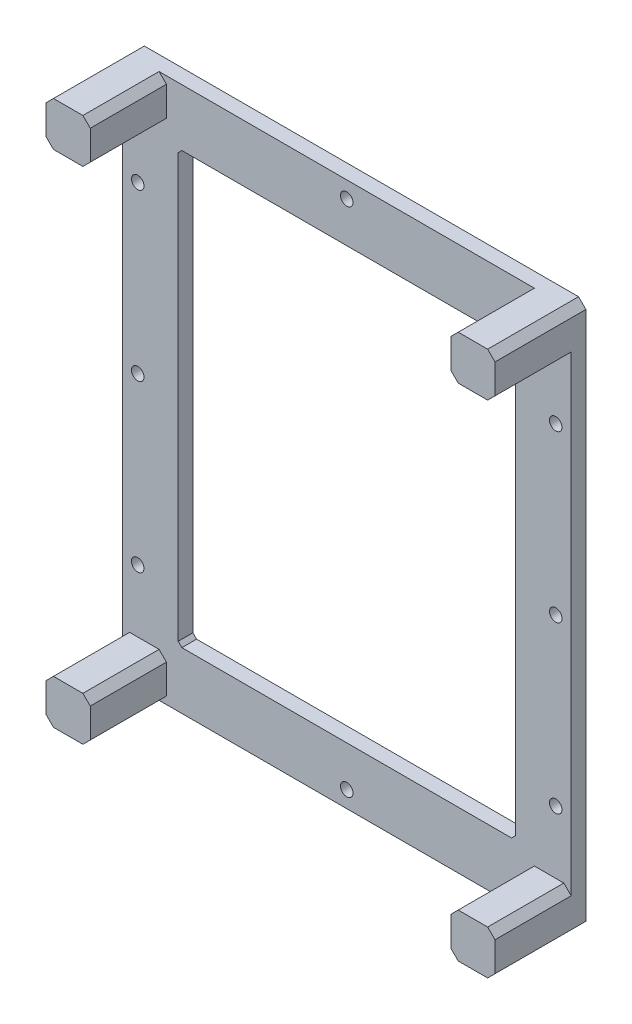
ISO-10303-21;
HEADER;
FILE_DESCRIPTION(('STEP AP214'),'2;1');
FILE_NAME('part.step','',(''),(''),'','','');
FILE_SCHEMA(('AUTOMOTIVE_DESIGN { 1 0 10303 214 1 1 1 1 }'));
ENDSEC;
DATA;
#1=APPLICATION_CONTEXT('core data for automotive mechanical design processes');
#2=APPLICATION_PROTOCOL_DEFINITION('international standard','automotive_design',2000,#1);
#3=PRODUCT_CONTEXT('',#1,'mechanical');
#4=PRODUCT('Part','Part','',(#3));
#5=PRODUCT_RELATED_PRODUCT_CATEGORY('part','',(#4));
#6=PRODUCT_DEFINITION_FORMATION('','',#4);
#7=PRODUCT_DEFINITION_CONTEXT('part definition',#1,'design');
#8=PRODUCT_DEFINITION('design','',#6,#7);
#9=PRODUCT_DEFINITION_SHAPE('','',#8);
#10=(LENGTH_UNIT() NAMED_UNIT(*) SI_UNIT(.MILLI.,.METRE.));
#11=(NAMED_UNIT(*) PLANE_ANGLE_UNIT() SI_UNIT($,.RADIAN.));
#12=(NAMED_UNIT(*) SI_UNIT($,.STERADIAN.) SOLID_ANGLE_UNIT());
#13=UNCERTAINTY_MEASURE_WITH_UNIT(LENGTH_MEASURE(1.E-05),#10,'distance_accuracy_value','');
#14=(GEOMETRIC_REPRESENTATION_CONTEXT(3) GLOBAL_UNCERTAINTY_ASSIGNED_CONTEXT((#13)) GLOBAL_UNIT_ASSIGNED_CONTEXT((#10,
#11,#12)) REPRESENTATION_CONTEXT('',''));
#15=CARTESIAN_POINT('',(0.,0.,0.));
#16=DIRECTION('',(0.,0.,1.));
#17=DIRECTION('',(1.,0.,0.));
#18=AXIS2_PLACEMENT_3D('',#15,#16,#17);
#19=CARTESIAN_POINT('',(0.,0.,4.));
#20=DIRECTION('',(0.,0.,1.));
#21=DIRECTION('',(1.,0.,0.));
#22=AXIS2_PLACEMENT_3D('',#19,#20,#21);
#23=PLANE('',#22);
#24=DIRECTION('',(0.707106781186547,-0.707106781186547,0.));
#25=VECTOR('',#24,1.);
#26=CARTESIAN_POINT('',(-61.,64.,4.));
#27=LINE('',#26,#25);
#28=CARTESIAN_POINT('',(-61.,64.,4.));
#29=VERTEX_POINT('',#28);
#30=CARTESIAN_POINT('',(-59.,62.,4.));
#31=VERTEX_POINT('',#30);
#32=EDGE_CURVE('E388',#29,#31,#27,.T.);
#33=ORIENTED_EDGE('',*,*,#32,.F.);
#34=DIRECTION('',(0.,-1.,0.));
#35=VECTOR('',#34,1.);
#36=CARTESIAN_POINT('',(-61.,72.,4.));
#37=LINE('',#36,#35);
#38=CARTESIAN_POINT('',(-61.,-64.0000000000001,4.));
#39=VERTEX_POINT('',#38);
#40=EDGE_CURVE('E623',#29,#39,#37,.T.);
#41=ORIENTED_EDGE('',*,*,#40,.T.);
#42=DIRECTION('',(-0.707106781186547,-0.707106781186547,0.));
#43=VECTOR('',#42,1.);
#44=CARTESIAN_POINT('',(-59.,-62.,4.));
#45=LINE('',#44,#43);
#46=CARTESIAN_POINT('',(-59.,-62.,4.));
#47=VERTEX_POINT('',#46);
#48=EDGE_CURVE('E463',#47,#39,#45,.T.);
#49=ORIENTED_EDGE('',*,*,#48,.F.);
#50=DIRECTION('',(-1.,0.,0.));
#51=VECTOR('',#50,1.);
#52=CARTESIAN_POINT('',(-51.,-62.,4.));
#53=LINE('',#52,#51);
#54=CARTESIAN_POINT('',(-51.,-62.,4.));
#55=VERTEX_POINT('',#54);
#56=EDGE_CURVE('E487',#55,#47,#53,.T.);
#57=ORIENTED_EDGE('',*,*,#56,.F.);
#58=DIRECTION('',(-0.707106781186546,0.707106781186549,0.));
#59=VECTOR('',#58,1.);
#60=CARTESIAN_POINT('',(-49.,-64.,4.));
#61=LINE('',#60,#59);
#62=CARTESIAN_POINT('',(-49.,-64.,4.));
#63=VERTEX_POINT('',#62);
#64=EDGE_CURVE('E484',#63,#55,#61,.T.);
#65=ORIENTED_EDGE('',*,*,#64,.F.);
#66=DIRECTION('',(0.,1.,0.));
#67=VECTOR('',#66,1.);
#68=CARTESIAN_POINT('',(-49.,-72.,4.));
#69=LINE('',#68,#67);
#70=CARTESIAN_POINT('',(-49.,-72.,4.));
#71=VERTEX_POINT('',#70);
#72=EDGE_CURVE('E481',#71,#63,#69,.T.);
#73=ORIENTED_EDGE('',*,*,#72,.F.);
#74=DIRECTION('',(0.707106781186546,0.707106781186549,0.));
#75=VECTOR('',#74,1.);
#76=CARTESIAN_POINT('',(-51.,-74.,4.));
#77=LINE('',#76,#75);
#78=CARTESIAN_POINT('',(-51.,-74.,4.));
#79=VERTEX_POINT('',#78);
#80=EDGE_CURVE('E391',#79,#71,#77,.T.);
#81=ORIENTED_EDGE('',*,*,#80,.F.);
#82=DIRECTION('',(1.,0.,0.));
#83=VECTOR('',#82,1.);
#84=CARTESIAN_POINT('',(-59.,-74.,4.));
#85=LINE('',#84,#83);
#86=CARTESIAN_POINT('',(51.,-74.,4.));
#87=VERTEX_POINT('',#86);
#88=EDGE_CURVE('E617',#79,#87,#85,.T.);
#89=ORIENTED_EDGE('',*,*,#88,.T.);
#90=DIRECTION('',(0.707106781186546,-0.707106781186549,0.));
#91=VECTOR('',#90,1.);
#92=CARTESIAN_POINT('',(49.,-72.,4.));
#93=LINE('',#92,#91);
#94=CARTESIAN_POINT('',(49.,-72.,4.));
#95=VERTEX_POINT('',#94);
#96=EDGE_CURVE('E364',#95,#87,#93,.T.);
#97=ORIENTED_EDGE('',*,*,#96,.F.);
#98=DIRECTION('',(0.,-1.,0.));
#99=VECTOR('',#98,1.);
#100=CARTESIAN_POINT('',(49.,-64.,4.));
#101=LINE('',#100,#99);
#102=CARTESIAN_POINT('',(49.,-64.,4.));
#103=VERTEX_POINT('',#102);
#104=EDGE_CURVE('E427',#103,#95,#101,.T.);
#105=ORIENTED_EDGE('',*,*,#104,.F.);
#106=DIRECTION('',(-0.707106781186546,-0.707106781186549,0.));
#107=VECTOR('',#106,1.);
#108=CARTESIAN_POINT('',(51.,-62.,4.));
#109=LINE('',#108,#107);
#110=CARTESIAN_POINT('',(51.,-62.,4.));
#111=VERTEX_POINT('',#110);
#112=EDGE_CURVE('E430',#111,#103,#109,.T.);
#113=ORIENTED_EDGE('',*,*,#112,.F.);
#114=DIRECTION('',(-1.,0.,0.));
#115=VECTOR('',#114,1.);
#116=CARTESIAN_POINT('',(59.,-62.,4.));
#117=LINE('',#116,#115);
#118=CARTESIAN_POINT('',(59.,-62.,4.));
#119=VERTEX_POINT('',#118);
#120=EDGE_CURVE('E434',#119,#111,#117,.T.);
#121=ORIENTED_EDGE('',*,*,#120,.F.);
#122=DIRECTION('',(-0.707106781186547,0.707106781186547,0.));
#123=VECTOR('',#122,1.);
#124=CARTESIAN_POINT('',(61.,-64.,4.));
#125=LINE('',#124,#123);
#126=CARTESIAN_POINT('',(61.,-64.,4.));
#127=VERTEX_POINT('',#126);
#128=EDGE_CURVE('E437',#127,#119,#125,.T.);
#129=ORIENTED_EDGE('',*,*,#128,.F.);
#130=DIRECTION('',(0.,1.,0.));
#131=VECTOR('',#130,1.);
#132=CARTESIAN_POINT('',(61.,-72.,4.));
#133=LINE('',#132,#131);
#134=CARTESIAN_POINT('',(61.,64.0000000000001,4.));
#135=VERTEX_POINT('',#134);
#136=EDGE_CURVE('E302',#127,#135,#133,.T.);
#137=ORIENTED_EDGE('',*,*,#136,.T.);
#138=DIRECTION('',(0.707106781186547,0.707106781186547,0.));
#139=VECTOR('',#138,1.);
#140=CARTESIAN_POINT('',(59.,62.,4.));
#141=LINE('',#140,#139);
#142=CARTESIAN_POINT('',(59.,62.,4.));
#143=VERTEX_POINT('',#142);
#144=EDGE_CURVE('E296',#143,#135,#141,.T.);
#145=ORIENTED_EDGE('',*,*,#144,.F.);
#146=DIRECTION('',(1.,0.,0.));
#147=VECTOR('',#146,1.);
#148=CARTESIAN_POINT('',(51.,62.,4.));
#149=LINE('',#148,#147);
#150=CARTESIAN_POINT('',(51.,62.,4.));
#151=VERTEX_POINT('',#150);
#152=EDGE_CURVE('E299',#151,#143,#149,.T.);
#153=ORIENTED_EDGE('',*,*,#152,.F.);
#154=DIRECTION('',(0.707106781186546,-0.707106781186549,0.));
#155=VECTOR('',#154,1.);
#156=CARTESIAN_POINT('',(49.,64.,4.));
#157=LINE('',#156,#155);
#158=CARTESIAN_POINT('',(49.,64.,4.));
#159=VERTEX_POINT('',#158);
#160=EDGE_CURVE('E317',#159,#151,#157,.T.);
#161=ORIENTED_EDGE('',*,*,#160,.F.);
#162=DIRECTION('',(0.,-1.,0.));
#163=VECTOR('',#162,1.);
#164=CARTESIAN_POINT('',(49.,72.,4.));
#165=LINE('',#164,#163);
#166=CARTESIAN_POINT('',(49.,72.,4.));
#167=VERTEX_POINT('',#166);
#168=EDGE_CURVE('E336',#167,#159,#165,.T.);
#169=ORIENTED_EDGE('',*,*,#168,.F.);
#170=DIRECTION('',(-0.707106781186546,-0.707106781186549,0.));
#171=VECTOR('',#170,1.);
#172=CARTESIAN_POINT('',(51.,74.,4.));
#173=LINE('',#172,#171);
#174=CARTESIAN_POINT('',(51.,74.,4.));
#175=VERTEX_POINT('',#174);
#176=EDGE_CURVE('E307',#175,#167,#173,.T.);
#177=ORIENTED_EDGE('',*,*,#176,.F.);
#178=DIRECTION('',(-1.,0.,0.));
#179=VECTOR('',#178,1.);
#180=CARTESIAN_POINT('',(59.,74.,4.));
#181=LINE('',#180,#179);
#182=CARTESIAN_POINT('',(-51.,74.,4.));
#183=VERTEX_POINT('',#182);
#184=EDGE_CURVE('E621',#175,#183,#181,.T.);
#185=ORIENTED_EDGE('',*,*,#184,.T.);
#186=DIRECTION('',(-0.707106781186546,0.707106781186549,0.));
#187=VECTOR('',#186,1.);
#188=CARTESIAN_POINT('',(-49.,72.,4.));
#189=LINE('',#188,#187);
#190=CARTESIAN_POINT('',(-49.,72.,4.));
#191=VERTEX_POINT('',#190);
#192=EDGE_CURVE('E58',#191,#183,#189,.T.);
#193=ORIENTED_EDGE('',*,*,#192,.F.);
#194=DIRECTION('',(0.,1.,0.));
#195=VECTOR('',#194,1.);
#196=CARTESIAN_POINT('',(-49.,64.,4.));
#197=LINE('',#196,#195);
#198=CARTESIAN_POINT('',(-49.,64.,4.));
#199=VERTEX_POINT('',#198);
#200=EDGE_CURVE('E62',#199,#191,#197,.T.);
#201=ORIENTED_EDGE('',*,*,#200,.F.);
#202=DIRECTION('',(0.707106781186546,0.707106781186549,0.));
#203=VECTOR('',#202,1.);
#204=CARTESIAN_POINT('',(-51.,62.,4.));
#205=LINE('',#204,#203);
#206=CARTESIAN_POINT('',(-51.,62.,4.));
#207=VERTEX_POINT('',#206);
#208=EDGE_CURVE('E383',#207,#199,#205,.T.);
#209=ORIENTED_EDGE('',*,*,#208,.F.);
#210=DIRECTION('',(1.,0.,0.));
#211=VECTOR('',#210,1.);
#212=CARTESIAN_POINT('',(-59.,62.,4.));
#213=LINE('',#212,#211);
#214=EDGE_CURVE('E385',#31,#207,#213,.T.);
#215=ORIENTED_EDGE('',*,*,#214,.F.);
#216=EDGE_LOOP('',(#33,#41,#49,#57,#65,#73,#81,#89,#97,#105,#113,#121,#129,#137,#145,#153,#161,
#169,#177,#185,#193,#201,#209,#215));
#217=FACE_BOUND('',#216,.T.);
#218=CARTESIAN_POINT('',(0.,-69.5,4.));
#219=DIRECTION('',(0.,0.,1.));
#220=DIRECTION('',(1.,0.,0.));
#221=AXIS2_PLACEMENT_3D('',#218,#219,#220);
#222=CIRCLE('',#221,1.7);
#223=CARTESIAN_POINT('',(1.7,-69.5,4.));
#224=VERTEX_POINT('',#223);
#225=EDGE_CURVE('E516',#224,#224,#222,.T.);
#226=ORIENTED_EDGE('',*,*,#225,.F.);
#227=EDGE_LOOP('',(#226));
#228=FACE_BOUND('',#227,.T.);
#229=CARTESIAN_POINT('',(56.8,0.,4.));
#230=DIRECTION('',(0.,0.,1.));
#231=DIRECTION('',(1.,0.,0.));
#232=AXIS2_PLACEMENT_3D('',#229,#230,#231);
#233=CIRCLE('',#232,1.7);
#234=CARTESIAN_POINT('',(58.5,0.,4.));
#235=VERTEX_POINT('',#234);
#236=EDGE_CURVE('E528',#235,#235,#233,.T.);
#237=ORIENTED_EDGE('',*,*,#236,.F.);
#238=EDGE_LOOP('',(#237));
#239=FACE_BOUND('',#238,.T.);
#240=CARTESIAN_POINT('',(-56.8,45.,4.));
#241=DIRECTION('',(0.,0.,1.));
#242=DIRECTION('',(1.,0.,0.));
#243=AXIS2_PLACEMENT_3D('',#240,#241,#242);
#244=CIRCLE('',#243,1.7);
#245=CARTESIAN_POINT('',(-55.1,45.,4.));
#246=VERTEX_POINT('',#245);
#247=EDGE_CURVE('E540',#246,#246,#244,.T.);
#248=ORIENTED_EDGE('',*,*,#247,.F.);
#249=EDGE_LOOP('',(#248));
#250=FACE_BOUND('',#249,.T.);
#251=CARTESIAN_POINT('',(-56.8,-45.,4.));
#252=DIRECTION('',(0.,0.,1.));
#253=DIRECTION('',(1.,0.,0.));
#254=AXIS2_PLACEMENT_3D('',#251,#252,#253);
#255=CIRCLE('',#254,1.7);
#256=CARTESIAN_POINT('',(-55.1,-45.,4.));
#257=VERTEX_POINT('',#256);
#258=EDGE_CURVE('E552',#257,#257,#255,.T.);
#259=ORIENTED_EDGE('',*,*,#258,.F.);
#260=EDGE_LOOP('',(#259));
#261=FACE_BOUND('',#260,.T.);
#262=DIRECTION('',(1.,0.,0.));
#263=VECTOR('',#262,1.);
#264=CARTESIAN_POINT('',(-44.8,-58.5,4.));
#265=LINE('',#264,#263);
#266=CARTESIAN_POINT('',(-44.8,-58.5,4.));
#267=VERTEX_POINT('',#266);
#268=CARTESIAN_POINT('',(44.8,-58.5,4.));
#269=VERTEX_POINT('',#268);
#270=EDGE_CURVE('E560',#267,#269,#265,.T.);
#271=ORIENTED_EDGE('',*,*,#270,.F.);
#272=DIRECTION('',(0.707106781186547,-0.707106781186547,0.));
#273=VECTOR('',#272,1.);
#274=CARTESIAN_POINT('',(-45.8,-57.5,4.));
#275=LINE('',#274,#273);
#276=CARTESIAN_POINT('',(-45.8,-57.5,4.));
#277=VERTEX_POINT('',#276);
#278=EDGE_CURVE('E558',#277,#267,#275,.T.);
#279=ORIENTED_EDGE('',*,*,#278,.F.);
#280=DIRECTION('',(0.,-1.,0.));
#281=VECTOR('',#280,1.);
#282=CARTESIAN_POINT('',(-45.8,57.5,4.));
#283=LINE('',#282,#281);
#284=CARTESIAN_POINT('',(-45.8,57.5,4.));
#285=VERTEX_POINT('',#284);
#286=EDGE_CURVE('E574',#285,#277,#283,.T.);
#287=ORIENTED_EDGE('',*,*,#286,.F.);
#288=DIRECTION('',(-0.707106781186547,-0.707106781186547,0.));
#289=VECTOR('',#288,1.);
#290=CARTESIAN_POINT('',(-44.8,58.5,4.));
#291=LINE('',#290,#289);
#292=CARTESIAN_POINT('',(-44.8,58.5,4.));
#293=VERTEX_POINT('',#292);
#294=EDGE_CURVE('E571',#293,#285,#291,.T.);
#295=ORIENTED_EDGE('',*,*,#294,.F.);
#296=DIRECTION('',(-1.,0.,0.));
#297=VECTOR('',#296,1.);
#298=CARTESIAN_POINT('',(44.8,58.5,4.));
#299=LINE('',#298,#297);
#300=CARTESIAN_POINT('',(44.8,58.5,4.));
#301=VERTEX_POINT('',#300);
#302=EDGE_CURVE('E569',#301,#293,#299,.T.);
#303=ORIENTED_EDGE('',*,*,#302,.F.);
#304=DIRECTION('',(-0.707106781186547,0.707106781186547,0.));
#305=VECTOR('',#304,1.);
#306=CARTESIAN_POINT('',(45.8,57.5,4.));
#307=LINE('',#306,#305);
#308=CARTESIAN_POINT('',(45.8,57.5,4.));
#309=VERTEX_POINT('',#308);
#310=EDGE_CURVE('E567',#309,#301,#307,.T.);
#311=ORIENTED_EDGE('',*,*,#310,.F.);
#312=DIRECTION('',(0.,1.,0.));
#313=VECTOR('',#312,1.);
#314=CARTESIAN_POINT('',(45.8,-57.5,4.));
#315=LINE('',#314,#313);
#316=CARTESIAN_POINT('',(45.8,-57.5,4.));
#317=VERTEX_POINT('',#316);
#318=EDGE_CURVE('E565',#317,#309,#315,.T.);
#319=ORIENTED_EDGE('',*,*,#318,.F.);
#320=DIRECTION('',(0.707106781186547,0.707106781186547,0.));
#321=VECTOR('',#320,1.);
#322=CARTESIAN_POINT('',(44.8,-58.5,4.));
#323=LINE('',#322,#321);
#324=EDGE_CURVE('E563',#269,#317,#323,.T.);
#325=ORIENTED_EDGE('',*,*,#324,.F.);
#326=EDGE_LOOP('',(#271,#279,#287,#295,#303,#311,#319,#325));
#327=FACE_BOUND('',#326,.T.);
#328=CARTESIAN_POINT('',(-56.8,0.,4.));
#329=DIRECTION('',(0.,0.,1.));
#330=DIRECTION('',(1.,0.,0.));
#331=AXIS2_PLACEMENT_3D('',#328,#329,#330);
#332=CIRCLE('',#331,1.7);
#333=CARTESIAN_POINT('',(-55.1,0.,4.));
#334=VERTEX_POINT('',#333);
#335=EDGE_CURVE('E546',#334,#334,#332,.T.);
#336=ORIENTED_EDGE('',*,*,#335,.F.);
#337=EDGE_LOOP('',(#336));
#338=FACE_BOUND('',#337,.T.);
#339=CARTESIAN_POINT('',(56.8,-45.,4.));
#340=DIRECTION('',(0.,0.,1.));
#341=DIRECTION('',(1.,0.,0.));
#342=AXIS2_PLACEMENT_3D('',#339,#340,#341);
#343=CIRCLE('',#342,1.7);
#344=CARTESIAN_POINT('',(58.5,-45.,4.));
#345=VERTEX_POINT('',#344);
#346=EDGE_CURVE('E534',#345,#345,#343,.T.);
#347=ORIENTED_EDGE('',*,*,#346,.F.);
#348=EDGE_LOOP('',(#347));
#349=FACE_BOUND('',#348,.T.);
#350=CARTESIAN_POINT('',(56.8,45.,4.));
#351=DIRECTION('',(0.,0.,1.));
#352=DIRECTION('',(1.,0.,0.));
#353=AXIS2_PLACEMENT_3D('',#350,#351,#352);
#354=CIRCLE('',#353,1.7);
#355=CARTESIAN_POINT('',(58.5,45.,4.));
#356=VERTEX_POINT('',#355);
#357=EDGE_CURVE('E522',#356,#356,#354,.T.);
#358=ORIENTED_EDGE('',*,*,#357,.F.);
#359=EDGE_LOOP('',(#358));
#360=FACE_BOUND('',#359,.T.);
#361=CARTESIAN_POINT('',(0.,69.5,4.));
#362=DIRECTION('',(0.,0.,1.));
#363=DIRECTION('',(1.,0.,0.));
#364=AXIS2_PLACEMENT_3D('',#361,#362,#363);
#365=CIRCLE('',#364,1.7);
#366=CARTESIAN_POINT('',(1.7,69.5,4.));
#367=VERTEX_POINT('',#366);
#368=EDGE_CURVE('E510',#367,#367,#365,.T.);
#369=ORIENTED_EDGE('',*,*,#368,.F.);
#370=EDGE_LOOP('',(#369));
#371=FACE_BOUND('',#370,.T.);
#372=ADVANCED_FACE('F43',(#217,#228,#239,#250,#261,#327,#338,#349,#360,#371),#23,.T.);
#373=CARTESIAN_POINT('',(0.,0.,0.));
#374=DIRECTION('',(0.,0.,1.));
#375=DIRECTION('',(1.,0.,0.));
#376=AXIS2_PLACEMENT_3D('',#373,#374,#375);
#377=PLANE('',#376);
#378=DIRECTION('',(0.707106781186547,-0.707106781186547,0.));
#379=VECTOR('',#378,1.);
#380=CARTESIAN_POINT('',(-61.,-72.,0.));
#381=LINE('',#380,#379);
#382=CARTESIAN_POINT('',(-61.,-72.,0.));
#383=VERTEX_POINT('',#382);
#384=CARTESIAN_POINT('',(-59.,-74.,0.));
#385=VERTEX_POINT('',#384);
#386=EDGE_CURVE('E616',#383,#385,#381,.T.);
#387=ORIENTED_EDGE('',*,*,#386,.F.);
#388=DIRECTION('',(0.,-1.,0.));
#389=VECTOR('',#388,1.);
#390=CARTESIAN_POINT('',(-61.,72.,0.));
#391=LINE('',#390,#389);
#392=CARTESIAN_POINT('',(-61.,72.,0.));
#393=VERTEX_POINT('',#392);
#394=EDGE_CURVE('E619',#393,#383,#391,.T.);
#395=ORIENTED_EDGE('',*,*,#394,.F.);
#396=DIRECTION('',(-0.707106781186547,-0.707106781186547,0.));
#397=VECTOR('',#396,1.);
#398=CARTESIAN_POINT('',(-59.,74.,0.));
#399=LINE('',#398,#397);
#400=CARTESIAN_POINT('',(-59.,74.,0.));
#401=VERTEX_POINT('',#400);
#402=EDGE_CURVE('E638',#401,#393,#399,.T.);
#403=ORIENTED_EDGE('',*,*,#402,.F.);
#404=DIRECTION('',(-1.,0.,0.));
#405=VECTOR('',#404,1.);
#406=CARTESIAN_POINT('',(59.,74.,0.));
#407=LINE('',#406,#405);
#408=CARTESIAN_POINT('',(59.,74.,0.));
#409=VERTEX_POINT('',#408);
#410=EDGE_CURVE('E636',#409,#401,#407,.T.);
#411=ORIENTED_EDGE('',*,*,#410,.F.);
#412=DIRECTION('',(-0.707106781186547,0.707106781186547,0.));
#413=VECTOR('',#412,1.);
#414=CARTESIAN_POINT('',(61.,72.,0.));
#415=LINE('',#414,#413);
#416=CARTESIAN_POINT('',(61.,72.,0.));
#417=VERTEX_POINT('',#416);
#418=EDGE_CURVE('E634',#417,#409,#415,.T.);
#419=ORIENTED_EDGE('',*,*,#418,.F.);
#420=DIRECTION('',(0.,1.,0.));
#421=VECTOR('',#420,1.);
#422=CARTESIAN_POINT('',(61.,-72.,0.));
#423=LINE('',#422,#421);
#424=CARTESIAN_POINT('',(61.,-72.,0.));
#425=VERTEX_POINT('',#424);
#426=EDGE_CURVE('E632',#425,#417,#423,.T.);
#427=ORIENTED_EDGE('',*,*,#426,.F.);
#428=DIRECTION('',(0.707106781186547,0.707106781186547,0.));
#429=VECTOR('',#428,1.);
#430=CARTESIAN_POINT('',(59.,-74.,0.));
#431=LINE('',#430,#429);
#432=CARTESIAN_POINT('',(59.,-74.,0.));
#433=VERTEX_POINT('',#432);
#434=EDGE_CURVE('E630',#433,#425,#431,.T.);
#435=ORIENTED_EDGE('',*,*,#434,.F.);
#436=DIRECTION('',(1.,0.,0.));
#437=VECTOR('',#436,1.);
#438=CARTESIAN_POINT('',(-59.,-74.,0.));
#439=LINE('',#438,#437);
#440=EDGE_CURVE('E628',#385,#433,#439,.T.);
#441=ORIENTED_EDGE('',*,*,#440,.F.);
#442=EDGE_LOOP('',(#387,#395,#403,#411,#419,#427,#435,#441));
#443=FACE_BOUND('',#442,.T.);
#444=DIRECTION('',(0.707106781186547,-0.707106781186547,0.));
#445=VECTOR('',#444,1.);
#446=CARTESIAN_POINT('',(-45.8,-57.5,0.));
#447=LINE('',#446,#445);
#448=CARTESIAN_POINT('',(-45.8,-57.5,0.));
#449=VERTEX_POINT('',#448);
#450=CARTESIAN_POINT('',(-44.8,-58.5,0.));
#451=VERTEX_POINT('',#450);
#452=EDGE_CURVE('E555',#449,#451,#447,.T.);
#453=ORIENTED_EDGE('',*,*,#452,.T.);
#454=DIRECTION('',(1.,0.,0.));
#455=VECTOR('',#454,1.);
#456=CARTESIAN_POINT('',(-44.8,-58.5,0.));
#457=LINE('',#456,#455);
#458=CARTESIAN_POINT('',(44.8,-58.5,0.));
#459=VERTEX_POINT('',#458);
#460=EDGE_CURVE('E579',#451,#459,#457,.T.);
#461=ORIENTED_EDGE('',*,*,#460,.T.);
#462=DIRECTION('',(0.707106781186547,0.707106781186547,0.));
#463=VECTOR('',#462,1.);
#464=CARTESIAN_POINT('',(44.8,-58.5,0.));
#465=LINE('',#464,#463);
#466=CARTESIAN_POINT('',(45.8,-57.5,0.));
#467=VERTEX_POINT('',#466);
#468=EDGE_CURVE('E582',#459,#467,#465,.T.);
#469=ORIENTED_EDGE('',*,*,#468,.T.);
#470=DIRECTION('',(0.,1.,0.));
#471=VECTOR('',#470,1.);
#472=CARTESIAN_POINT('',(45.8,-57.5,0.));
#473=LINE('',#472,#471);
#474=CARTESIAN_POINT('',(45.8,57.5,0.));
#475=VERTEX_POINT('',#474);
#476=EDGE_CURVE('E585',#467,#475,#473,.T.);
#477=ORIENTED_EDGE('',*,*,#476,.T.);
#478=DIRECTION('',(-0.707106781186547,0.707106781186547,0.));
#479=VECTOR('',#478,1.);
#480=CARTESIAN_POINT('',(45.8,57.5,0.));
#481=LINE('',#480,#479);
#482=CARTESIAN_POINT('',(44.8,58.5,0.));
#483=VERTEX_POINT('',#482);
#484=EDGE_CURVE('E588',#475,#483,#481,.T.);
#485=ORIENTED_EDGE('',*,*,#484,.T.);
#486=DIRECTION('',(-1.,0.,0.));
#487=VECTOR('',#486,1.);
#488=CARTESIAN_POINT('',(44.8,58.5,0.));
#489=LINE('',#488,#487);
#490=CARTESIAN_POINT('',(-44.8,58.5,0.));
#491=VERTEX_POINT('',#490);
#492=EDGE_CURVE('E591',#483,#491,#489,.T.);
#493=ORIENTED_EDGE('',*,*,#492,.T.);
#494=DIRECTION('',(-0.707106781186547,-0.707106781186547,0.));
#495=VECTOR('',#494,1.);
#496=CARTESIAN_POINT('',(-44.8,58.5,0.));
#497=LINE('',#496,#495);
#498=CARTESIAN_POINT('',(-45.8,57.5,0.));
#499=VERTEX_POINT('',#498);
#500=EDGE_CURVE('E594',#491,#499,#497,.T.);
#501=ORIENTED_EDGE('',*,*,#500,.T.);
#502=DIRECTION('',(0.,-1.,0.));
#503=VECTOR('',#502,1.);
#504=CARTESIAN_POINT('',(-45.8,57.5,0.));
#505=LINE('',#504,#503);
#506=EDGE_CURVE('E561',#499,#449,#505,.T.);
#507=ORIENTED_EDGE('',*,*,#506,.T.);
#508=EDGE_LOOP('',(#453,#461,#469,#477,#485,#493,#501,#507));
#509=FACE_BOUND('',#508,.T.);
#510=CARTESIAN_POINT('',(-56.8,-45.,0.));
#511=DIRECTION('',(0.,0.,1.));
#512=DIRECTION('',(1.,0.,0.));
#513=AXIS2_PLACEMENT_3D('',#510,#511,#512);
#514=CIRCLE('',#513,1.7);
#515=CARTESIAN_POINT('',(-55.1,-45.,0.));
#516=VERTEX_POINT('',#515);
#517=EDGE_CURVE('E549',#516,#516,#514,.T.);
#518=ORIENTED_EDGE('',*,*,#517,.T.);
#519=EDGE_LOOP('',(#518));
#520=FACE_BOUND('',#519,.T.);
#521=CARTESIAN_POINT('',(-56.8,0.,0.));
#522=DIRECTION('',(0.,0.,1.));
#523=DIRECTION('',(1.,0.,0.));
#524=AXIS2_PLACEMENT_3D('',#521,#522,#523);
#525=CIRCLE('',#524,1.7);
#526=CARTESIAN_POINT('',(-55.1,0.,0.));
#527=VERTEX_POINT('',#526);
#528=EDGE_CURVE('E543',#527,#527,#525,.T.);
#529=ORIENTED_EDGE('',*,*,#528,.T.);
#530=EDGE_LOOP('',(#529));
#531=FACE_BOUND('',#530,.T.);
#532=CARTESIAN_POINT('',(-56.8,45.,0.));
#533=DIRECTION('',(0.,0.,1.));
#534=DIRECTION('',(1.,0.,0.));
#535=AXIS2_PLACEMENT_3D('',#532,#533,#534);
#536=CIRCLE('',#535,1.7);
#537=CARTESIAN_POINT('',(-55.1,45.,0.));
#538=VERTEX_POINT('',#537);
#539=EDGE_CURVE('E537',#538,#538,#536,.T.);
#540=ORIENTED_EDGE('',*,*,#539,.T.);
#541=EDGE_LOOP('',(#540));
#542=FACE_BOUND('',#541,.T.);
#543=CARTESIAN_POINT('',(56.8,-45.,0.));
#544=DIRECTION('',(0.,0.,1.));
#545=DIRECTION('',(1.,0.,0.));
#546=AXIS2_PLACEMENT_3D('',#543,#544,#545);
#547=CIRCLE('',#546,1.7);
#548=CARTESIAN_POINT('',(58.5,-45.,0.));
#549=VERTEX_POINT('',#548);
#550=EDGE_CURVE('E531',#549,#549,#547,.T.);
#551=ORIENTED_EDGE('',*,*,#550,.T.);
#552=EDGE_LOOP('',(#551));
#553=FACE_BOUND('',#552,.T.);
#554=CARTESIAN_POINT('',(56.8,0.,0.));
#555=DIRECTION('',(0.,0.,1.));
#556=DIRECTION('',(1.,0.,0.));
#557=AXIS2_PLACEMENT_3D('',#554,#555,#556);
#558=CIRCLE('',#557,1.7);
#559=CARTESIAN_POINT('',(58.5,0.,0.));
#560=VERTEX_POINT('',#559);
#561=EDGE_CURVE('E525',#560,#560,#558,.T.);
#562=ORIENTED_EDGE('',*,*,#561,.T.);
#563=EDGE_LOOP('',(#562));
#564=FACE_BOUND('',#563,.T.);
#565=CARTESIAN_POINT('',(56.8,45.,0.));
#566=DIRECTION('',(0.,0.,1.));
#567=DIRECTION('',(1.,0.,0.));
#568=AXIS2_PLACEMENT_3D('',#565,#566,#567);
#569=CIRCLE('',#568,1.7);
#570=CARTESIAN_POINT('',(58.5,45.,0.));
#571=VERTEX_POINT('',#570);
#572=EDGE_CURVE('E519',#571,#571,#569,.T.);
#573=ORIENTED_EDGE('',*,*,#572,.T.);
#574=EDGE_LOOP('',(#573));
#575=FACE_BOUND('',#574,.T.);
#576=CARTESIAN_POINT('',(0.,-69.5,0.));
#577=DIRECTION('',(0.,0.,1.));
#578=DIRECTION('',(1.,0.,0.));
#579=AXIS2_PLACEMENT_3D('',#576,#577,#578);
#580=CIRCLE('',#579,1.7);
#581=CARTESIAN_POINT('',(1.7,-69.5,0.));
#582=VERTEX_POINT('',#581);
#583=EDGE_CURVE('E513',#582,#582,#580,.T.);
#584=ORIENTED_EDGE('',*,*,#583,.T.);
#585=EDGE_LOOP('',(#584));
#586=FACE_BOUND('',#585,.T.);
#587=CARTESIAN_POINT('',(0.,69.5,0.));
#588=DIRECTION('',(0.,0.,1.));
#589=DIRECTION('',(1.,0.,0.));
#590=AXIS2_PLACEMENT_3D('',#587,#588,#589);
#591=CIRCLE('',#590,1.7);
#592=CARTESIAN_POINT('',(1.7,69.5,0.));
#593=VERTEX_POINT('',#592);
#594=EDGE_CURVE('E509',#593,#593,#591,.T.);
#595=ORIENTED_EDGE('',*,*,#594,.T.);
#596=EDGE_LOOP('',(#595));
#597=FACE_BOUND('',#596,.T.);
#598=ADVANCED_FACE('F666',(#443,#509,#520,#531,#542,#553,#564,#575,#586,#597),#377,.F.);
#599=CARTESIAN_POINT('',(-61.,-72.,4.));
#600=DIRECTION('',(0.707106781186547,0.707106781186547,0.));
#601=DIRECTION('',(-0.707106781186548,0.707106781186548,0.));
#602=AXIS2_PLACEMENT_3D('',#599,#600,#601);
#603=PLANE('',#602);
#604=ORIENTED_EDGE('',*,*,#386,.T.);
#605=DIRECTION('',(0.,0.,-1.));
#606=VECTOR('',#605,1.);
#607=CARTESIAN_POINT('',(-59.,-74.,4.));
#608=LINE('',#607,#606);
#609=CARTESIAN_POINT('',(-59.,-74.,24.7));
#610=VERTEX_POINT('',#609);
#611=EDGE_CURVE('E11',#610,#385,#608,.T.);
#612=ORIENTED_EDGE('',*,*,#611,.F.);
#613=DIRECTION('',(0.707106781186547,-0.707106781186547,0.));
#614=VECTOR('',#613,1.);
#615=CARTESIAN_POINT('',(-61.,-72.,24.7));
#616=LINE('',#615,#614);
#617=CARTESIAN_POINT('',(-61.,-72.,24.7));
#618=VERTEX_POINT('',#617);
#619=EDGE_CURVE('E459',#618,#610,#616,.T.);
#620=ORIENTED_EDGE('',*,*,#619,.F.);
#621=DIRECTION('',(0.,0.,-1.));
#622=VECTOR('',#621,1.);
#623=CARTESIAN_POINT('',(-61.,-72.,4.));
#624=LINE('',#623,#622);
#625=EDGE_CURVE('E625',#618,#383,#624,.T.);
#626=ORIENTED_EDGE('',*,*,#625,.T.);
#627=EDGE_LOOP('',(#604,#612,#620,#626));
#628=FACE_BOUND('',#627,.T.);
#629=ADVANCED_FACE('F45',(#628),#603,.F.);
#630=CARTESIAN_POINT('',(-59.,-74.,4.));
#631=DIRECTION('',(0.,1.,0.));
#632=DIRECTION('',(0.,0.,1.));
#633=AXIS2_PLACEMENT_3D('',#630,#631,#632);
#634=PLANE('',#633);
#635=ORIENTED_EDGE('',*,*,#440,.T.);
#636=DIRECTION('',(0.,0.,-1.));
#637=VECTOR('',#636,1.);
#638=CARTESIAN_POINT('',(59.,-74.,4.));
#639=LINE('',#638,#637);
#640=CARTESIAN_POINT('',(59.,-74.,24.7));
#641=VERTEX_POINT('',#640);
#642=EDGE_CURVE('E51',#641,#433,#639,.T.);
#643=ORIENTED_EDGE('',*,*,#642,.F.);
#644=DIRECTION('',(1.,0.,0.));
#645=VECTOR('',#644,1.);
#646=CARTESIAN_POINT('',(51.,-74.,24.7));
#647=LINE('',#646,#645);
#648=CARTESIAN_POINT('',(51.,-74.,24.7));
#649=VERTEX_POINT('',#648);
#650=EDGE_CURVE('E454',#649,#641,#647,.T.);
#651=ORIENTED_EDGE('',*,*,#650,.F.);
#652=DIRECTION('',(0.,0.,-1.));
#653=VECTOR('',#652,1.);
#654=CARTESIAN_POINT('',(51.,-74.,24.7));
#655=LINE('',#654,#653);
#656=EDGE_CURVE('E343',#649,#87,#655,.T.);
#657=ORIENTED_EDGE('',*,*,#656,.T.);
#658=ORIENTED_EDGE('',*,*,#88,.F.);
#659=DIRECTION('',(0.,0.,-1.));
#660=VECTOR('',#659,1.);
#661=CARTESIAN_POINT('',(-51.,-74.,24.7));
#662=LINE('',#661,#660);
#663=CARTESIAN_POINT('',(-51.,-74.,24.7));
#664=VERTEX_POINT('',#663);
#665=EDGE_CURVE('E506',#664,#79,#662,.T.);
#666=ORIENTED_EDGE('',*,*,#665,.F.);
#667=DIRECTION('',(1.,0.,0.));
#668=VECTOR('',#667,1.);
#669=CARTESIAN_POINT('',(-59.,-74.,24.7));
#670=LINE('',#669,#668);
#671=EDGE_CURVE('E462',#610,#664,#670,.T.);
#672=ORIENTED_EDGE('',*,*,#671,.F.);
#673=ORIENTED_EDGE('',*,*,#611,.T.);
#674=EDGE_LOOP('',(#635,#643,#651,#657,#658,#666,#672,#673));
#675=FACE_BOUND('',#674,.T.);
#676=ADVANCED_FACE('F770',(#675),#634,.F.);
#677=CARTESIAN_POINT('',(59.,-74.,4.));
#678=DIRECTION('',(-0.707106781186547,0.707106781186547,0.));
#679=DIRECTION('',(-0.707106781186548,-0.707106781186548,0.));
#680=AXIS2_PLACEMENT_3D('',#677,#678,#679);
#681=PLANE('',#680);
#682=ORIENTED_EDGE('',*,*,#434,.T.);
#683=DIRECTION('',(0.,0.,-1.));
#684=VECTOR('',#683,1.);
#685=CARTESIAN_POINT('',(61.,-72.,4.));
#686=LINE('',#685,#684);
#687=CARTESIAN_POINT('',(61.,-72.,24.7));
#688=VERTEX_POINT('',#687);
#689=EDGE_CURVE('E655',#688,#425,#686,.T.);
#690=ORIENTED_EDGE('',*,*,#689,.F.);
#691=DIRECTION('',(0.707106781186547,0.707106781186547,0.));
#692=VECTOR('',#691,1.);
#693=CARTESIAN_POINT('',(59.,-74.,24.7));
#694=LINE('',#693,#692);
#695=EDGE_CURVE('E451',#641,#688,#694,.T.);
#696=ORIENTED_EDGE('',*,*,#695,.F.);
#697=ORIENTED_EDGE('',*,*,#642,.T.);
#698=EDGE_LOOP('',(#682,#690,#696,#697));
#699=FACE_BOUND('',#698,.T.);
#700=ADVANCED_FACE('F661',(#699),#681,.F.);
#701=CARTESIAN_POINT('',(61.,-72.,4.));
#702=DIRECTION('',(-1.,0.,0.));
#703=DIRECTION('',(0.,0.,1.));
#704=AXIS2_PLACEMENT_3D('',#701,#702,#703);
#705=PLANE('',#704);
#706=ORIENTED_EDGE('',*,*,#426,.T.);
#707=DIRECTION('',(0.,0.,-1.));
#708=VECTOR('',#707,1.);
#709=CARTESIAN_POINT('',(61.,72.,4.));
#710=LINE('',#709,#708);
#711=CARTESIAN_POINT('',(61.,72.,24.7));
#712=VERTEX_POINT('',#711);
#713=EDGE_CURVE('E652',#712,#417,#710,.T.);
#714=ORIENTED_EDGE('',*,*,#713,.F.);
#715=DIRECTION('',(0.,1.,0.));
#716=VECTOR('',#715,1.);
#717=CARTESIAN_POINT('',(61.,64.,24.7));
#718=LINE('',#717,#716);
#719=CARTESIAN_POINT('',(61.,64.,24.7));
#720=VERTEX_POINT('',#719);
#721=EDGE_CURVE('E352',#720,#712,#718,.T.);
#722=ORIENTED_EDGE('',*,*,#721,.F.);
#723=DIRECTION('',(0.,0.,-1.));
#724=VECTOR('',#723,1.);
#725=CARTESIAN_POINT('',(61.,64.,24.7));
#726=LINE('',#725,#724);
#727=EDGE_CURVE('E321',#720,#135,#726,.T.);
#728=ORIENTED_EDGE('',*,*,#727,.T.);
#729=ORIENTED_EDGE('',*,*,#136,.F.);
#730=DIRECTION('',(0.,0.,-1.));
#731=VECTOR('',#730,1.);
#732=CARTESIAN_POINT('',(61.,-64.,24.7));
#733=LINE('',#732,#731);
#734=CARTESIAN_POINT('',(61.,-64.,24.7));
#735=VERTEX_POINT('',#734);
#736=EDGE_CURVE('E411',#735,#127,#733,.T.);
#737=ORIENTED_EDGE('',*,*,#736,.F.);
#738=DIRECTION('',(0.,1.,0.));
#739=VECTOR('',#738,1.);
#740=CARTESIAN_POINT('',(61.,-72.,24.7));
#741=LINE('',#740,#739);
#742=EDGE_CURVE('E449',#688,#735,#741,.T.);
#743=ORIENTED_EDGE('',*,*,#742,.F.);
#744=ORIENTED_EDGE('',*,*,#689,.T.);
#745=EDGE_LOOP('',(#706,#714,#722,#728,#729,#737,#743,#744));
#746=FACE_BOUND('',#745,.T.);
#747=ADVANCED_FACE('F671',(#746),#705,.F.);
#748=CARTESIAN_POINT('',(61.,72.,4.));
#749=DIRECTION('',(-0.707106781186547,-0.707106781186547,0.));
#750=DIRECTION('',(0.707106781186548,-0.707106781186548,0.));
#751=AXIS2_PLACEMENT_3D('',#748,#749,#750);
#752=PLANE('',#751);
#753=ORIENTED_EDGE('',*,*,#418,.T.);
#754=DIRECTION('',(0.,0.,-1.));
#755=VECTOR('',#754,1.);
#756=CARTESIAN_POINT('',(59.,74.,4.));
#757=LINE('',#756,#755);
#758=CARTESIAN_POINT('',(59.,74.,24.7));
#759=VERTEX_POINT('',#758);
#760=EDGE_CURVE('E649',#759,#409,#757,.T.);
#761=ORIENTED_EDGE('',*,*,#760,.F.);
#762=DIRECTION('',(-0.707106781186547,0.707106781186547,0.));
#763=VECTOR('',#762,1.);
#764=CARTESIAN_POINT('',(61.,72.,24.7));
#765=LINE('',#764,#763);
#766=EDGE_CURVE('E349',#712,#759,#765,.T.);
#767=ORIENTED_EDGE('',*,*,#766,.F.);
#768=ORIENTED_EDGE('',*,*,#713,.T.);
#769=EDGE_LOOP('',(#753,#761,#767,#768));
#770=FACE_BOUND('',#769,.T.);
#771=ADVANCED_FACE('F676',(#770),#752,.F.);
#772=CARTESIAN_POINT('',(59.,74.,4.));
#773=DIRECTION('',(0.,-1.,0.));
#774=DIRECTION('',(0.,0.,-1.));
#775=AXIS2_PLACEMENT_3D('',#772,#773,#774);
#776=PLANE('',#775);
#777=ORIENTED_EDGE('',*,*,#410,.T.);
#778=DIRECTION('',(0.,0.,-1.));
#779=VECTOR('',#778,1.);
#780=CARTESIAN_POINT('',(-59.,74.,4.));
#781=LINE('',#780,#779);
#782=CARTESIAN_POINT('',(-59.,74.,24.7));
#783=VERTEX_POINT('',#782);
#784=EDGE_CURVE('E646',#783,#401,#781,.T.);
#785=ORIENTED_EDGE('',*,*,#784,.F.);
#786=DIRECTION('',(-1.,0.,0.));
#787=VECTOR('',#786,1.);
#788=CARTESIAN_POINT('',(-51.,74.,24.7));
#789=LINE('',#788,#787);
#790=CARTESIAN_POINT('',(-51.,74.,24.7));
#791=VERTEX_POINT('',#790);
#792=EDGE_CURVE('E396',#791,#783,#789,.T.);
#793=ORIENTED_EDGE('',*,*,#792,.F.);
#794=DIRECTION('',(0.,0.,-1.));
#795=VECTOR('',#794,1.);
#796=CARTESIAN_POINT('',(-51.,74.,24.7));
#797=LINE('',#796,#795);
#798=EDGE_CURVE('E373',#791,#183,#797,.T.);
#799=ORIENTED_EDGE('',*,*,#798,.T.);
#800=ORIENTED_EDGE('',*,*,#184,.F.);
#801=DIRECTION('',(0.,0.,-1.));
#802=VECTOR('',#801,1.);
#803=CARTESIAN_POINT('',(51.,74.,24.7));
#804=LINE('',#803,#802);
#805=CARTESIAN_POINT('',(51.,74.,24.7));
#806=VERTEX_POINT('',#805);
#807=EDGE_CURVE('E323',#806,#175,#804,.T.);
#808=ORIENTED_EDGE('',*,*,#807,.F.);
#809=DIRECTION('',(-1.,0.,0.));
#810=VECTOR('',#809,1.);
#811=CARTESIAN_POINT('',(59.,74.,24.7));
#812=LINE('',#811,#810);
#813=EDGE_CURVE('E347',#759,#806,#812,.T.);
#814=ORIENTED_EDGE('',*,*,#813,.F.);
#815=ORIENTED_EDGE('',*,*,#760,.T.);
#816=EDGE_LOOP('',(#777,#785,#793,#799,#800,#808,#814,#815));
#817=FACE_BOUND('',#816,.T.);
#818=ADVANCED_FACE('F682',(#817),#776,.F.);
#819=CARTESIAN_POINT('',(-59.,74.,4.));
#820=DIRECTION('',(0.707106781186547,-0.707106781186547,0.));
#821=DIRECTION('',(0.707106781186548,0.707106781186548,0.));
#822=AXIS2_PLACEMENT_3D('',#819,#820,#821);
#823=PLANE('',#822);
#824=ORIENTED_EDGE('',*,*,#402,.T.);
#825=DIRECTION('',(0.,0.,-1.));
#826=VECTOR('',#825,1.);
#827=CARTESIAN_POINT('',(-61.,72.,4.));
#828=LINE('',#827,#826);
#829=CARTESIAN_POINT('',(-61.,72.,24.7));
#830=VERTEX_POINT('',#829);
#831=EDGE_CURVE('E643',#830,#393,#828,.T.);
#832=ORIENTED_EDGE('',*,*,#831,.F.);
#833=DIRECTION('',(-0.707106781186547,-0.707106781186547,0.));
#834=VECTOR('',#833,1.);
#835=CARTESIAN_POINT('',(-59.,74.,24.7));
#836=LINE('',#835,#834);
#837=EDGE_CURVE('E393',#783,#830,#836,.T.);
#838=ORIENTED_EDGE('',*,*,#837,.F.);
#839=ORIENTED_EDGE('',*,*,#784,.T.);
#840=EDGE_LOOP('',(#824,#832,#838,#839));
#841=FACE_BOUND('',#840,.T.);
#842=ADVANCED_FACE('F706',(#841),#823,.F.);
#843=CARTESIAN_POINT('',(-61.,72.,4.));
#844=DIRECTION('',(1.,0.,0.));
#845=DIRECTION('',(0.,0.,-1.));
#846=AXIS2_PLACEMENT_3D('',#843,#844,#845);
#847=PLANE('',#846);
#848=ORIENTED_EDGE('',*,*,#394,.T.);
#849=ORIENTED_EDGE('',*,*,#625,.F.);
#850=DIRECTION('',(0.,-1.,0.));
#851=VECTOR('',#850,1.);
#852=CARTESIAN_POINT('',(-61.,-64.,24.7));
#853=LINE('',#852,#851);
#854=CARTESIAN_POINT('',(-61.,-64.,24.7));
#855=VERTEX_POINT('',#854);
#856=EDGE_CURVE('E475',#855,#618,#853,.T.);
#857=ORIENTED_EDGE('',*,*,#856,.F.);
#858=DIRECTION('',(0.,0.,-1.));
#859=VECTOR('',#858,1.);
#860=CARTESIAN_POINT('',(-61.,-64.,24.7));
#861=LINE('',#860,#859);
#862=EDGE_CURVE('E478',#855,#39,#861,.T.);
#863=ORIENTED_EDGE('',*,*,#862,.T.);
#864=ORIENTED_EDGE('',*,*,#40,.F.);
#865=DIRECTION('',(0.,0.,-1.));
#866=VECTOR('',#865,1.);
#867=CARTESIAN_POINT('',(-61.,64.,24.7));
#868=LINE('',#867,#866);
#869=CARTESIAN_POINT('',(-61.,64.,24.7));
#870=VERTEX_POINT('',#869);
#871=EDGE_CURVE('E376',#870,#29,#868,.T.);
#872=ORIENTED_EDGE('',*,*,#871,.F.);
#873=DIRECTION('',(0.,-1.,0.));
#874=VECTOR('',#873,1.);
#875=CARTESIAN_POINT('',(-61.,72.,24.7));
#876=LINE('',#875,#874);
#877=EDGE_CURVE('E379',#830,#870,#876,.T.);
#878=ORIENTED_EDGE('',*,*,#877,.F.);
#879=ORIENTED_EDGE('',*,*,#831,.T.);
#880=EDGE_LOOP('',(#848,#849,#857,#863,#864,#872,#878,#879));
#881=FACE_BOUND('',#880,.T.);
#882=ADVANCED_FACE('F710',(#881),#847,.F.);
#883=CARTESIAN_POINT('',(-45.8,-57.5,4.));
#884=DIRECTION('',(0.707106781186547,0.707106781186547,0.));
#885=DIRECTION('',(-0.707106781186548,0.707106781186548,0.));
#886=AXIS2_PLACEMENT_3D('',#883,#884,#885);
#887=PLANE('',#886);
#888=ORIENTED_EDGE('',*,*,#452,.F.);
#889=DIRECTION('',(0.,0.,-1.));
#890=VECTOR('',#889,1.);
#891=CARTESIAN_POINT('',(-45.8,-57.5,4.));
#892=LINE('',#891,#890);
#893=EDGE_CURVE('E576',#277,#449,#892,.T.);
#894=ORIENTED_EDGE('',*,*,#893,.F.);
#895=ORIENTED_EDGE('',*,*,#278,.T.);
#896=DIRECTION('',(0.,0.,-1.));
#897=VECTOR('',#896,1.);
#898=CARTESIAN_POINT('',(-44.8,-58.5,4.));
#899=LINE('',#898,#897);
#900=EDGE_CURVE('E613',#267,#451,#899,.T.);
#901=ORIENTED_EDGE('',*,*,#900,.T.);
#902=EDGE_LOOP('',(#888,#894,#895,#901));
#903=FACE_BOUND('',#902,.T.);
#904=ADVANCED_FACE('F756',(#903),#887,.T.);
#905=CARTESIAN_POINT('',(-44.8,-58.5,4.));
#906=DIRECTION('',(0.,1.,0.));
#907=DIRECTION('',(0.,0.,1.));
#908=AXIS2_PLACEMENT_3D('',#905,#906,#907);
#909=PLANE('',#908);
#910=ORIENTED_EDGE('',*,*,#460,.F.);
#911=ORIENTED_EDGE('',*,*,#900,.F.);
#912=ORIENTED_EDGE('',*,*,#270,.T.);
#913=DIRECTION('',(0.,0.,-1.));
#914=VECTOR('',#913,1.);
#915=CARTESIAN_POINT('',(44.8,-58.5,4.));
#916=LINE('',#915,#914);
#917=EDGE_CURVE('E611',#269,#459,#916,.T.);
#918=ORIENTED_EDGE('',*,*,#917,.T.);
#919=EDGE_LOOP('',(#910,#911,#912,#918));
#920=FACE_BOUND('',#919,.T.);
#921=ADVANCED_FACE('F888',(#920),#909,.T.);
#922=CARTESIAN_POINT('',(44.8,-58.5,4.));
#923=DIRECTION('',(-0.707106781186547,0.707106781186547,0.));
#924=DIRECTION('',(-0.707106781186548,-0.707106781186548,0.));
#925=AXIS2_PLACEMENT_3D('',#922,#923,#924);
#926=PLANE('',#925);
#927=ORIENTED_EDGE('',*,*,#468,.F.);
#928=ORIENTED_EDGE('',*,*,#917,.F.);
#929=ORIENTED_EDGE('',*,*,#324,.T.);
#930=DIRECTION('',(0.,0.,-1.));
#931=VECTOR('',#930,1.);
#932=CARTESIAN_POINT('',(45.8,-57.5,4.));
#933=LINE('',#932,#931);
#934=EDGE_CURVE('E609',#317,#467,#933,.T.);
#935=ORIENTED_EDGE('',*,*,#934,.T.);
#936=EDGE_LOOP('',(#927,#928,#929,#935));
#937=FACE_BOUND('',#936,.T.);
#938=ADVANCED_FACE('F885',(#937),#926,.T.);
#939=CARTESIAN_POINT('',(45.8,-57.5,4.));
#940=DIRECTION('',(-1.,0.,0.));
#941=DIRECTION('',(0.,0.,1.));
#942=AXIS2_PLACEMENT_3D('',#939,#940,#941);
#943=PLANE('',#942);
#944=ORIENTED_EDGE('',*,*,#476,.F.);
#945=ORIENTED_EDGE('',*,*,#934,.F.);
#946=ORIENTED_EDGE('',*,*,#318,.T.);
#947=DIRECTION('',(0.,0.,-1.));
#948=VECTOR('',#947,1.);
#949=CARTESIAN_POINT('',(45.8,57.5,4.));
#950=LINE('',#949,#948);
#951=EDGE_CURVE('E607',#309,#475,#950,.T.);
#952=ORIENTED_EDGE('',*,*,#951,.T.);
#953=EDGE_LOOP('',(#944,#945,#946,#952));
#954=FACE_BOUND('',#953,.T.);
#955=ADVANCED_FACE('F881',(#954),#943,.T.);
#956=CARTESIAN_POINT('',(45.8,57.5,4.));
#957=DIRECTION('',(-0.707106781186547,-0.707106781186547,0.));
#958=DIRECTION('',(0.707106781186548,-0.707106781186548,0.));
#959=AXIS2_PLACEMENT_3D('',#956,#957,#958);
#960=PLANE('',#959);
#961=ORIENTED_EDGE('',*,*,#484,.F.);
#962=ORIENTED_EDGE('',*,*,#951,.F.);
#963=ORIENTED_EDGE('',*,*,#310,.T.);
#964=DIRECTION('',(0.,0.,-1.));
#965=VECTOR('',#964,1.);
#966=CARTESIAN_POINT('',(44.8,58.5,4.));
#967=LINE('',#966,#965);
#968=EDGE_CURVE('E605',#301,#483,#967,.T.);
#969=ORIENTED_EDGE('',*,*,#968,.T.);
#970=EDGE_LOOP('',(#961,#962,#963,#969));
#971=FACE_BOUND('',#970,.T.);
#972=ADVANCED_FACE('F877',(#971),#960,.T.);
#973=CARTESIAN_POINT('',(44.8,58.5,4.));
#974=DIRECTION('',(0.,-1.,0.));
#975=DIRECTION('',(0.,0.,-1.));
#976=AXIS2_PLACEMENT_3D('',#973,#974,#975);
#977=PLANE('',#976);
#978=ORIENTED_EDGE('',*,*,#492,.F.);
#979=ORIENTED_EDGE('',*,*,#968,.F.);
#980=ORIENTED_EDGE('',*,*,#302,.T.);
#981=DIRECTION('',(0.,0.,-1.));
#982=VECTOR('',#981,1.);
#983=CARTESIAN_POINT('',(-44.8,58.5,4.));
#984=LINE('',#983,#982);
#985=EDGE_CURVE('E603',#293,#491,#984,.T.);
#986=ORIENTED_EDGE('',*,*,#985,.T.);
#987=EDGE_LOOP('',(#978,#979,#980,#986));
#988=FACE_BOUND('',#987,.T.);
#989=ADVANCED_FACE('F873',(#988),#977,.T.);
#990=CARTESIAN_POINT('',(-44.8,58.5,4.));
#991=DIRECTION('',(0.707106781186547,-0.707106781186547,0.));
#992=DIRECTION('',(0.707106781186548,0.707106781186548,0.));
#993=AXIS2_PLACEMENT_3D('',#990,#991,#992);
#994=PLANE('',#993);
#995=ORIENTED_EDGE('',*,*,#500,.F.);
#996=ORIENTED_EDGE('',*,*,#985,.F.);
#997=ORIENTED_EDGE('',*,*,#294,.T.);
#998=DIRECTION('',(0.,0.,-1.));
#999=VECTOR('',#998,1.);
#1000=CARTESIAN_POINT('',(-45.8,57.5,4.));
#1001=LINE('',#1000,#999);
#1002=EDGE_CURVE('E601',#285,#499,#1001,.T.);
#1003=ORIENTED_EDGE('',*,*,#1002,.T.);
#1004=EDGE_LOOP('',(#995,#996,#997,#1003));
#1005=FACE_BOUND('',#1004,.T.);
#1006=ADVANCED_FACE('F869',(#1005),#994,.T.);
#1007=CARTESIAN_POINT('',(-45.8,57.5,4.));
#1008=DIRECTION('',(1.,0.,0.));
#1009=DIRECTION('',(0.,0.,-1.));
#1010=AXIS2_PLACEMENT_3D('',#1007,#1008,#1009);
#1011=PLANE('',#1010);
#1012=ORIENTED_EDGE('',*,*,#506,.F.);
#1013=ORIENTED_EDGE('',*,*,#1002,.F.);
#1014=ORIENTED_EDGE('',*,*,#286,.T.);
#1015=ORIENTED_EDGE('',*,*,#893,.T.);
#1016=EDGE_LOOP('',(#1012,#1013,#1014,#1015));
#1017=FACE_BOUND('',#1016,.T.);
#1018=ADVANCED_FACE('F865',(#1017),#1011,.T.);
#1019=CARTESIAN_POINT('',(-56.8,-45.,4.));
#1020=DIRECTION('',(0.,0.,-1.));
#1021=DIRECTION('',(-1.,0.,0.));
#1022=AXIS2_PLACEMENT_3D('',#1019,#1020,#1021);
#1023=CYLINDRICAL_SURFACE('',#1022,1.7);
#1024=ORIENTED_EDGE('',*,*,#258,.T.);
#1025=EDGE_LOOP('',(#1024));
#1026=FACE_BOUND('',#1025,.T.);
#1027=ORIENTED_EDGE('',*,*,#517,.F.);
#1028=EDGE_LOOP('',(#1027));
#1029=FACE_BOUND('',#1028,.T.);
#1030=ADVANCED_FACE('F861',(#1026,#1029),#1023,.F.);
#1031=CARTESIAN_POINT('',(-56.8,0.,4.));
#1032=DIRECTION('',(0.,0.,-1.));
#1033=DIRECTION('',(-1.,0.,0.));
#1034=AXIS2_PLACEMENT_3D('',#1031,#1032,#1033);
#1035=CYLINDRICAL_SURFACE('',#1034,1.7);
#1036=ORIENTED_EDGE('',*,*,#335,.T.);
#1037=EDGE_LOOP('',(#1036));
#1038=FACE_BOUND('',#1037,.T.);
#1039=ORIENTED_EDGE('',*,*,#528,.F.);
#1040=EDGE_LOOP('',(#1039));
#1041=FACE_BOUND('',#1040,.T.);
#1042=ADVANCED_FACE('F857',(#1038,#1041),#1035,.F.);
#1043=CARTESIAN_POINT('',(-56.8,45.,4.));
#1044=DIRECTION('',(0.,0.,-1.));
#1045=DIRECTION('',(-1.,0.,0.));
#1046=AXIS2_PLACEMENT_3D('',#1043,#1044,#1045);
#1047=CYLINDRICAL_SURFACE('',#1046,1.7);
#1048=ORIENTED_EDGE('',*,*,#247,.T.);
#1049=EDGE_LOOP('',(#1048));
#1050=FACE_BOUND('',#1049,.T.);
#1051=ORIENTED_EDGE('',*,*,#539,.F.);
#1052=EDGE_LOOP('',(#1051));
#1053=FACE_BOUND('',#1052,.T.);
#1054=ADVANCED_FACE('F853',(#1050,#1053),#1047,.F.);
#1055=CARTESIAN_POINT('',(56.8,-45.,4.));
#1056=DIRECTION('',(0.,0.,-1.));
#1057=DIRECTION('',(-1.,0.,0.));
#1058=AXIS2_PLACEMENT_3D('',#1055,#1056,#1057);
#1059=CYLINDRICAL_SURFACE('',#1058,1.7);
#1060=ORIENTED_EDGE('',*,*,#346,.T.);
#1061=EDGE_LOOP('',(#1060));
#1062=FACE_BOUND('',#1061,.T.);
#1063=ORIENTED_EDGE('',*,*,#550,.F.);
#1064=EDGE_LOOP('',(#1063));
#1065=FACE_BOUND('',#1064,.T.);
#1066=ADVANCED_FACE('F849',(#1062,#1065),#1059,.F.);
#1067=CARTESIAN_POINT('',(56.8,0.,4.));
#1068=DIRECTION('',(0.,0.,-1.));
#1069=DIRECTION('',(-1.,0.,0.));
#1070=AXIS2_PLACEMENT_3D('',#1067,#1068,#1069);
#1071=CYLINDRICAL_SURFACE('',#1070,1.7);
#1072=ORIENTED_EDGE('',*,*,#236,.T.);
#1073=EDGE_LOOP('',(#1072));
#1074=FACE_BOUND('',#1073,.T.);
#1075=ORIENTED_EDGE('',*,*,#561,.F.);
#1076=EDGE_LOOP('',(#1075));
#1077=FACE_BOUND('',#1076,.T.);
#1078=ADVANCED_FACE('F845',(#1074,#1077),#1071,.F.);
#1079=CARTESIAN_POINT('',(56.8,45.,4.));
#1080=DIRECTION('',(0.,0.,-1.));
#1081=DIRECTION('',(-1.,0.,0.));
#1082=AXIS2_PLACEMENT_3D('',#1079,#1080,#1081);
#1083=CYLINDRICAL_SURFACE('',#1082,1.7);
#1084=ORIENTED_EDGE('',*,*,#357,.T.);
#1085=EDGE_LOOP('',(#1084));
#1086=FACE_BOUND('',#1085,.T.);
#1087=ORIENTED_EDGE('',*,*,#572,.F.);
#1088=EDGE_LOOP('',(#1087));
#1089=FACE_BOUND('',#1088,.T.);
#1090=ADVANCED_FACE('F841',(#1086,#1089),#1083,.F.);
#1091=CARTESIAN_POINT('',(0.,-69.5,4.));
#1092=DIRECTION('',(0.,0.,-1.));
#1093=DIRECTION('',(-1.,0.,0.));
#1094=AXIS2_PLACEMENT_3D('',#1091,#1092,#1093);
#1095=CYLINDRICAL_SURFACE('',#1094,1.7);
#1096=ORIENTED_EDGE('',*,*,#225,.T.);
#1097=EDGE_LOOP('',(#1096));
#1098=FACE_BOUND('',#1097,.T.);
#1099=ORIENTED_EDGE('',*,*,#583,.F.);
#1100=EDGE_LOOP('',(#1099));
#1101=FACE_BOUND('',#1100,.T.);
#1102=ADVANCED_FACE('F837',(#1098,#1101),#1095,.F.);
#1103=CARTESIAN_POINT('',(0.,69.5,4.));
#1104=DIRECTION('',(0.,0.,-1.));
#1105=DIRECTION('',(-1.,0.,0.));
#1106=AXIS2_PLACEMENT_3D('',#1103,#1104,#1105);
#1107=CYLINDRICAL_SURFACE('',#1106,1.7);
#1108=ORIENTED_EDGE('',*,*,#368,.T.);
#1109=EDGE_LOOP('',(#1108));
#1110=FACE_BOUND('',#1109,.T.);
#1111=ORIENTED_EDGE('',*,*,#594,.F.);
#1112=EDGE_LOOP('',(#1111));
#1113=FACE_BOUND('',#1112,.T.);
#1114=ADVANCED_FACE('F835',(#1110,#1113),#1107,.F.);
#1115=CARTESIAN_POINT('',(-51.,-74.,24.7));
#1116=DIRECTION('',(-0.707106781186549,0.707106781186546,0.));
#1117=DIRECTION('',(-0.707106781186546,-0.707106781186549,0.));
#1118=AXIS2_PLACEMENT_3D('',#1115,#1116,#1117);
#1119=PLANE('',#1118);
#1120=ORIENTED_EDGE('',*,*,#80,.T.);
#1121=DIRECTION('',(0.,0.,-1.));
#1122=VECTOR('',#1121,1.);
#1123=CARTESIAN_POINT('',(-49.,-72.,24.7));
#1124=LINE('',#1123,#1122);
#1125=CARTESIAN_POINT('',(-49.,-72.,24.7));
#1126=VERTEX_POINT('',#1125);
#1127=EDGE_CURVE('E503',#1126,#71,#1124,.T.);
#1128=ORIENTED_EDGE('',*,*,#1127,.F.);
#1129=DIRECTION('',(0.707106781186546,0.707106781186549,0.));
#1130=VECTOR('',#1129,1.);
#1131=CARTESIAN_POINT('',(-51.,-74.,24.7));
#1132=LINE('',#1131,#1130);
#1133=EDGE_CURVE('E465',#664,#1126,#1132,.T.);
#1134=ORIENTED_EDGE('',*,*,#1133,.F.);
#1135=ORIENTED_EDGE('',*,*,#665,.T.);
#1136=EDGE_LOOP('',(#1120,#1128,#1134,#1135));
#1137=FACE_BOUND('',#1136,.T.);
#1138=ADVANCED_FACE('F781',(#1137),#1119,.F.);
#1139=CARTESIAN_POINT('',(-49.,-72.,24.7));
#1140=DIRECTION('',(-1.,0.,0.));
#1141=DIRECTION('',(0.,0.,1.));
#1142=AXIS2_PLACEMENT_3D('',#1139,#1140,#1141);
#1143=PLANE('',#1142);
#1144=ORIENTED_EDGE('',*,*,#72,.T.);
#1145=DIRECTION('',(0.,0.,-1.));
#1146=VECTOR('',#1145,1.);
#1147=CARTESIAN_POINT('',(-49.,-64.,24.7));
#1148=LINE('',#1147,#1146);
#1149=CARTESIAN_POINT('',(-49.,-64.,24.7));
#1150=VERTEX_POINT('',#1149);
#1151=EDGE_CURVE('E500',#1150,#63,#1148,.T.);
#1152=ORIENTED_EDGE('',*,*,#1151,.F.);
#1153=DIRECTION('',(0.,1.,0.));
#1154=VECTOR('',#1153,1.);
#1155=CARTESIAN_POINT('',(-49.,-72.,24.7));
#1156=LINE('',#1155,#1154);
#1157=EDGE_CURVE('E467',#1126,#1150,#1156,.T.);
#1158=ORIENTED_EDGE('',*,*,#1157,.F.);
#1159=ORIENTED_EDGE('',*,*,#1127,.T.);
#1160=EDGE_LOOP('',(#1144,#1152,#1158,#1159));
#1161=FACE_BOUND('',#1160,.T.);
#1162=ADVANCED_FACE('F783',(#1161),#1143,.F.);
#1163=CARTESIAN_POINT('',(-49.,-64.,24.7));
#1164=DIRECTION('',(-0.707106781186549,-0.707106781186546,0.));
#1165=DIRECTION('',(0.707106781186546,-0.707106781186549,0.));
#1166=AXIS2_PLACEMENT_3D('',#1163,#1164,#1165);
#1167=PLANE('',#1166);
#1168=ORIENTED_EDGE('',*,*,#64,.T.);
#1169=DIRECTION('',(0.,0.,-1.));
#1170=VECTOR('',#1169,1.);
#1171=CARTESIAN_POINT('',(-51.,-62.,24.7));
#1172=LINE('',#1171,#1170);
#1173=CARTESIAN_POINT('',(-51.,-62.,24.7));
#1174=VERTEX_POINT('',#1173);
#1175=EDGE_CURVE('E497',#1174,#55,#1172,.T.);
#1176=ORIENTED_EDGE('',*,*,#1175,.F.);
#1177=DIRECTION('',(-0.707106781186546,0.707106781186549,0.));
#1178=VECTOR('',#1177,1.);
#1179=CARTESIAN_POINT('',(-49.,-64.,24.7));
#1180=LINE('',#1179,#1178);
#1181=EDGE_CURVE('E469',#1150,#1174,#1180,.T.);
#1182=ORIENTED_EDGE('',*,*,#1181,.F.);
#1183=ORIENTED_EDGE('',*,*,#1151,.T.);
#1184=EDGE_LOOP('',(#1168,#1176,#1182,#1183));
#1185=FACE_BOUND('',#1184,.T.);
#1186=ADVANCED_FACE('F787',(#1185),#1167,.F.);
#1187=CARTESIAN_POINT('',(-51.,-62.,24.7));
#1188=DIRECTION('',(0.,-1.,0.));
#1189=DIRECTION('',(0.,0.,-1.));
#1190=AXIS2_PLACEMENT_3D('',#1187,#1188,#1189);
#1191=PLANE('',#1190);
#1192=ORIENTED_EDGE('',*,*,#56,.T.);
#1193=DIRECTION('',(0.,0.,-1.));
#1194=VECTOR('',#1193,1.);
#1195=CARTESIAN_POINT('',(-59.,-62.,24.7));
#1196=LINE('',#1195,#1194);
#1197=CARTESIAN_POINT('',(-59.,-62.,24.7));
#1198=VERTEX_POINT('',#1197);
#1199=EDGE_CURVE('E494',#1198,#47,#1196,.T.);
#1200=ORIENTED_EDGE('',*,*,#1199,.F.);
#1201=DIRECTION('',(-1.,0.,0.));
#1202=VECTOR('',#1201,1.);
#1203=CARTESIAN_POINT('',(-51.,-62.,24.7));
#1204=LINE('',#1203,#1202);
#1205=EDGE_CURVE('E471',#1174,#1198,#1204,.T.);
#1206=ORIENTED_EDGE('',*,*,#1205,.F.);
#1207=ORIENTED_EDGE('',*,*,#1175,.T.);
#1208=EDGE_LOOP('',(#1192,#1200,#1206,#1207));
#1209=FACE_BOUND('',#1208,.T.);
#1210=ADVANCED_FACE('F789',(#1209),#1191,.F.);
#1211=CARTESIAN_POINT('',(-59.,-62.,24.7));
#1212=DIRECTION('',(0.707106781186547,-0.707106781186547,0.));
#1213=DIRECTION('',(0.707106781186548,0.707106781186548,0.));
#1214=AXIS2_PLACEMENT_3D('',#1211,#1212,#1213);
#1215=PLANE('',#1214);
#1216=ORIENTED_EDGE('',*,*,#48,.T.);
#1217=ORIENTED_EDGE('',*,*,#862,.F.);
#1218=DIRECTION('',(-0.707106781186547,-0.707106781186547,0.));
#1219=VECTOR('',#1218,1.);
#1220=CARTESIAN_POINT('',(-59.,-62.,24.7));
#1221=LINE('',#1220,#1219);
#1222=EDGE_CURVE('E473',#1198,#855,#1221,.T.);
#1223=ORIENTED_EDGE('',*,*,#1222,.F.);
#1224=ORIENTED_EDGE('',*,*,#1199,.T.);
#1225=EDGE_LOOP('',(#1216,#1217,#1223,#1224));
#1226=FACE_BOUND('',#1225,.T.);
#1227=ADVANCED_FACE('F723',(#1226),#1215,.F.);
#1228=CARTESIAN_POINT('',(0.,0.,24.7));
#1229=DIRECTION('',(0.,0.,1.));
#1230=DIRECTION('',(1.,0.,0.));
#1231=AXIS2_PLACEMENT_3D('',#1228,#1229,#1230);
#1232=PLANE('',#1231);
#1233=ORIENTED_EDGE('',*,*,#619,.T.);
#1234=ORIENTED_EDGE('',*,*,#671,.T.);
#1235=ORIENTED_EDGE('',*,*,#1133,.T.);
#1236=ORIENTED_EDGE('',*,*,#1157,.T.);
#1237=ORIENTED_EDGE('',*,*,#1181,.T.);
#1238=ORIENTED_EDGE('',*,*,#1205,.T.);
#1239=ORIENTED_EDGE('',*,*,#1222,.T.);
#1240=ORIENTED_EDGE('',*,*,#856,.T.);
#1241=EDGE_LOOP('',(#1233,#1234,#1235,#1236,#1237,#1238,#1239,#1240));
#1242=FACE_BOUND('',#1241,.T.);
#1243=ADVANCED_FACE('F717',(#1242),#1232,.T.);
#1244=CARTESIAN_POINT('',(49.,64.,24.7));
#1245=DIRECTION('',(0.707106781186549,0.707106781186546,0.));
#1246=DIRECTION('',(-0.707106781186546,0.707106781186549,0.));
#1247=AXIS2_PLACEMENT_3D('',#1244,#1245,#1246);
#1248=PLANE('',#1247);
#1249=ORIENTED_EDGE('',*,*,#160,.T.);
#1250=DIRECTION('',(0.,0.,-1.));
#1251=VECTOR('',#1250,1.);
#1252=CARTESIAN_POINT('',(51.,62.,24.7));
#1253=LINE('',#1252,#1251);
#1254=CARTESIAN_POINT('',(51.,62.,24.7));
#1255=VERTEX_POINT('',#1254);
#1256=EDGE_CURVE('E315',#1255,#151,#1253,.T.);
#1257=ORIENTED_EDGE('',*,*,#1256,.F.);
#1258=DIRECTION('',(0.707106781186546,-0.707106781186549,0.));
#1259=VECTOR('',#1258,1.);
#1260=CARTESIAN_POINT('',(49.,64.,24.7));
#1261=LINE('',#1260,#1259);
#1262=CARTESIAN_POINT('',(49.,64.,24.7));
#1263=VERTEX_POINT('',#1262);
#1264=EDGE_CURVE('E339',#1263,#1255,#1261,.T.);
#1265=ORIENTED_EDGE('',*,*,#1264,.F.);
#1266=DIRECTION('',(0.,0.,-1.));
#1267=VECTOR('',#1266,1.);
#1268=CARTESIAN_POINT('',(49.,64.,24.7));
#1269=LINE('',#1268,#1267);
#1270=EDGE_CURVE('E332',#1263,#159,#1269,.T.);
#1271=ORIENTED_EDGE('',*,*,#1270,.T.);
#1272=EDGE_LOOP('',(#1249,#1257,#1265,#1271));
#1273=FACE_BOUND('',#1272,.T.);
#1274=ADVANCED_FACE('F694',(#1273),#1248,.F.);
#1275=CARTESIAN_POINT('',(51.,62.,24.7));
#1276=DIRECTION('',(0.,1.,0.));
#1277=DIRECTION('',(0.,0.,1.));
#1278=AXIS2_PLACEMENT_3D('',#1275,#1276,#1277);
#1279=PLANE('',#1278);
#1280=ORIENTED_EDGE('',*,*,#152,.T.);
#1281=DIRECTION('',(0.,0.,-1.));
#1282=VECTOR('',#1281,1.);
#1283=CARTESIAN_POINT('',(59.,62.,24.7));
#1284=LINE('',#1283,#1282);
#1285=CARTESIAN_POINT('',(59.,62.,24.7));
#1286=VERTEX_POINT('',#1285);
#1287=EDGE_CURVE('E312',#1286,#143,#1284,.T.);
#1288=ORIENTED_EDGE('',*,*,#1287,.F.);
#1289=DIRECTION('',(1.,0.,0.));
#1290=VECTOR('',#1289,1.);
#1291=CARTESIAN_POINT('',(51.,62.,24.7));
#1292=LINE('',#1291,#1290);
#1293=EDGE_CURVE('E356',#1255,#1286,#1292,.T.);
#1294=ORIENTED_EDGE('',*,*,#1293,.F.);
#1295=ORIENTED_EDGE('',*,*,#1256,.T.);
#1296=EDGE_LOOP('',(#1280,#1288,#1294,#1295));
#1297=FACE_BOUND('',#1296,.T.);
#1298=ADVANCED_FACE('F311',(#1297),#1279,.F.);
#1299=CARTESIAN_POINT('',(59.,62.,24.7));
#1300=DIRECTION('',(-0.707106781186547,0.707106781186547,0.));
#1301=DIRECTION('',(-0.707106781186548,-0.707106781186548,0.));
#1302=AXIS2_PLACEMENT_3D('',#1299,#1300,#1301);
#1303=PLANE('',#1302);
#1304=ORIENTED_EDGE('',*,*,#144,.T.);
#1305=ORIENTED_EDGE('',*,*,#727,.F.);
#1306=DIRECTION('',(0.707106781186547,0.707106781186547,0.));
#1307=VECTOR('',#1306,1.);
#1308=CARTESIAN_POINT('',(59.,62.,24.7));
#1309=LINE('',#1308,#1307);
#1310=EDGE_CURVE('E320',#1286,#720,#1309,.T.);
#1311=ORIENTED_EDGE('',*,*,#1310,.F.);
#1312=ORIENTED_EDGE('',*,*,#1287,.T.);
#1313=EDGE_LOOP('',(#1304,#1305,#1311,#1312));
#1314=FACE_BOUND('',#1313,.T.);
#1315=ADVANCED_FACE('F319',(#1314),#1303,.F.);
#1316=CARTESIAN_POINT('',(51.,74.,24.7));
#1317=DIRECTION('',(0.707106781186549,-0.707106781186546,0.));
#1318=DIRECTION('',(0.707106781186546,0.707106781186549,0.));
#1319=AXIS2_PLACEMENT_3D('',#1316,#1317,#1318);
#1320=PLANE('',#1319);
#1321=ORIENTED_EDGE('',*,*,#176,.T.);
#1322=DIRECTION('',(0.,0.,-1.));
#1323=VECTOR('',#1322,1.);
#1324=CARTESIAN_POINT('',(49.,72.,24.7));
#1325=LINE('',#1324,#1323);
#1326=CARTESIAN_POINT('',(49.,72.,24.7));
#1327=VERTEX_POINT('',#1326);
#1328=EDGE_CURVE('E329',#1327,#167,#1325,.T.);
#1329=ORIENTED_EDGE('',*,*,#1328,.F.);
#1330=DIRECTION('',(-0.707106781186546,-0.707106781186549,0.));
#1331=VECTOR('',#1330,1.);
#1332=CARTESIAN_POINT('',(51.,74.,24.7));
#1333=LINE('',#1332,#1331);
#1334=EDGE_CURVE('E345',#806,#1327,#1333,.T.);
#1335=ORIENTED_EDGE('',*,*,#1334,.F.);
#1336=ORIENTED_EDGE('',*,*,#807,.T.);
#1337=EDGE_LOOP('',(#1321,#1329,#1335,#1336));
#1338=FACE_BOUND('',#1337,.T.);
#1339=ADVANCED_FACE('F687',(#1338),#1320,.F.);
#1340=CARTESIAN_POINT('',(49.,72.,24.7));
#1341=DIRECTION('',(1.,0.,0.));
#1342=DIRECTION('',(0.,0.,-1.));
#1343=AXIS2_PLACEMENT_3D('',#1340,#1341,#1342);
#1344=PLANE('',#1343);
#1345=ORIENTED_EDGE('',*,*,#168,.T.);
#1346=ORIENTED_EDGE('',*,*,#1270,.F.);
#1347=DIRECTION('',(0.,-1.,0.));
#1348=VECTOR('',#1347,1.);
#1349=CARTESIAN_POINT('',(49.,72.,24.7));
#1350=LINE('',#1349,#1348);
#1351=EDGE_CURVE('E335',#1327,#1263,#1350,.T.);
#1352=ORIENTED_EDGE('',*,*,#1351,.F.);
#1353=ORIENTED_EDGE('',*,*,#1328,.T.);
#1354=EDGE_LOOP('',(#1345,#1346,#1352,#1353));
#1355=FACE_BOUND('',#1354,.T.);
#1356=ADVANCED_FACE('F692',(#1355),#1344,.F.);
#1357=CARTESIAN_POINT('',(0.,0.,24.7));
#1358=DIRECTION('',(0.,0.,1.));
#1359=DIRECTION('',(1.,0.,0.));
#1360=AXIS2_PLACEMENT_3D('',#1357,#1358,#1359);
#1361=PLANE('',#1360);
#1362=ORIENTED_EDGE('',*,*,#1264,.T.);
#1363=ORIENTED_EDGE('',*,*,#1293,.T.);
#1364=ORIENTED_EDGE('',*,*,#1310,.T.);
#1365=ORIENTED_EDGE('',*,*,#721,.T.);
#1366=ORIENTED_EDGE('',*,*,#766,.T.);
#1367=ORIENTED_EDGE('',*,*,#813,.T.);
#1368=ORIENTED_EDGE('',*,*,#1334,.T.);
#1369=ORIENTED_EDGE('',*,*,#1351,.T.);
#1370=EDGE_LOOP('',(#1362,#1363,#1364,#1365,#1366,#1367,#1368,#1369));
#1371=FACE_BOUND('',#1370,.T.);
#1372=ADVANCED_FACE('F679',(#1371),#1361,.T.);
#1373=CARTESIAN_POINT('',(49.,-72.,24.7));
#1374=DIRECTION('',(0.707106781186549,0.707106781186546,0.));
#1375=DIRECTION('',(-0.707106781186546,0.707106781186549,0.));
#1376=AXIS2_PLACEMENT_3D('',#1373,#1374,#1375);
#1377=PLANE('',#1376);
#1378=ORIENTED_EDGE('',*,*,#96,.T.);
#1379=ORIENTED_EDGE('',*,*,#656,.F.);
#1380=DIRECTION('',(0.707106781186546,-0.707106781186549,0.));
#1381=VECTOR('',#1380,1.);
#1382=CARTESIAN_POINT('',(49.,-72.,24.7));
#1383=LINE('',#1382,#1381);
#1384=CARTESIAN_POINT('',(49.,-72.,24.7));
#1385=VERTEX_POINT('',#1384);
#1386=EDGE_CURVE('E431',#1385,#649,#1383,.T.);
#1387=ORIENTED_EDGE('',*,*,#1386,.F.);
#1388=DIRECTION('',(0.,0.,-1.));
#1389=VECTOR('',#1388,1.);
#1390=CARTESIAN_POINT('',(49.,-72.,24.7));
#1391=LINE('',#1390,#1389);
#1392=EDGE_CURVE('E423',#1385,#95,#1391,.T.);
#1393=ORIENTED_EDGE('',*,*,#1392,.T.);
#1394=EDGE_LOOP('',(#1378,#1379,#1387,#1393));
#1395=FACE_BOUND('',#1394,.T.);
#1396=ADVANCED_FACE('F793',(#1395),#1377,.F.);
#1397=CARTESIAN_POINT('',(61.,-64.,24.7));
#1398=DIRECTION('',(-0.707106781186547,-0.707106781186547,0.));
#1399=DIRECTION('',(0.707106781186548,-0.707106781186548,0.));
#1400=AXIS2_PLACEMENT_3D('',#1397,#1398,#1399);
#1401=PLANE('',#1400);
#1402=ORIENTED_EDGE('',*,*,#128,.T.);
#1403=DIRECTION('',(0.,0.,-1.));
#1404=VECTOR('',#1403,1.);
#1405=CARTESIAN_POINT('',(59.,-62.,24.7));
#1406=LINE('',#1405,#1404);
#1407=CARTESIAN_POINT('',(59.,-62.,24.7));
#1408=VERTEX_POINT('',#1407);
#1409=EDGE_CURVE('E414',#1408,#119,#1406,.T.);
#1410=ORIENTED_EDGE('',*,*,#1409,.F.);
#1411=DIRECTION('',(-0.707106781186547,0.707106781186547,0.));
#1412=VECTOR('',#1411,1.);
#1413=CARTESIAN_POINT('',(61.,-64.,24.7));
#1414=LINE('',#1413,#1412);
#1415=EDGE_CURVE('E447',#735,#1408,#1414,.T.);
#1416=ORIENTED_EDGE('',*,*,#1415,.F.);
#1417=ORIENTED_EDGE('',*,*,#736,.T.);
#1418=EDGE_LOOP('',(#1402,#1410,#1416,#1417));
#1419=FACE_BOUND('',#1418,.T.);
#1420=ADVANCED_FACE('F809',(#1419),#1401,.F.);
#1421=CARTESIAN_POINT('',(59.,-62.,24.7));
#1422=DIRECTION('',(0.,-1.,0.));
#1423=DIRECTION('',(0.,0.,-1.));
#1424=AXIS2_PLACEMENT_3D('',#1421,#1422,#1423);
#1425=PLANE('',#1424);
#1426=ORIENTED_EDGE('',*,*,#120,.T.);
#1427=DIRECTION('',(0.,0.,-1.));
#1428=VECTOR('',#1427,1.);
#1429=CARTESIAN_POINT('',(51.,-62.,24.7));
#1430=LINE('',#1429,#1428);
#1431=CARTESIAN_POINT('',(51.,-62.,24.7));
#1432=VERTEX_POINT('',#1431);
#1433=EDGE_CURVE('E417',#1432,#111,#1430,.T.);
#1434=ORIENTED_EDGE('',*,*,#1433,.F.);
#1435=DIRECTION('',(-1.,0.,0.));
#1436=VECTOR('',#1435,1.);
#1437=CARTESIAN_POINT('',(59.,-62.,24.7));
#1438=LINE('',#1437,#1436);
#1439=EDGE_CURVE('E445',#1408,#1432,#1438,.T.);
#1440=ORIENTED_EDGE('',*,*,#1439,.F.);
#1441=ORIENTED_EDGE('',*,*,#1409,.T.);
#1442=EDGE_LOOP('',(#1426,#1434,#1440,#1441));
#1443=FACE_BOUND('',#1442,.T.);
#1444=ADVANCED_FACE('F804',(#1443),#1425,.F.);
#1445=CARTESIAN_POINT('',(51.,-62.,24.7));
#1446=DIRECTION('',(0.707106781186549,-0.707106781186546,0.));
#1447=DIRECTION('',(0.707106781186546,0.707106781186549,0.));
#1448=AXIS2_PLACEMENT_3D('',#1445,#1446,#1447);
#1449=PLANE('',#1448);
#1450=ORIENTED_EDGE('',*,*,#112,.T.);
#1451=DIRECTION('',(0.,0.,-1.));
#1452=VECTOR('',#1451,1.);
#1453=CARTESIAN_POINT('',(49.,-64.,24.7));
#1454=LINE('',#1453,#1452);
#1455=CARTESIAN_POINT('',(49.,-64.,24.7));
#1456=VERTEX_POINT('',#1455);
#1457=EDGE_CURVE('E420',#1456,#103,#1454,.T.);
#1458=ORIENTED_EDGE('',*,*,#1457,.F.);
#1459=DIRECTION('',(-0.707106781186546,-0.707106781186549,0.));
#1460=VECTOR('',#1459,1.);
#1461=CARTESIAN_POINT('',(51.,-62.,24.7));
#1462=LINE('',#1461,#1460);
#1463=EDGE_CURVE('E443',#1432,#1456,#1462,.T.);
#1464=ORIENTED_EDGE('',*,*,#1463,.F.);
#1465=ORIENTED_EDGE('',*,*,#1433,.T.);
#1466=EDGE_LOOP('',(#1450,#1458,#1464,#1465));
#1467=FACE_BOUND('',#1466,.T.);
#1468=ADVANCED_FACE('F801',(#1467),#1449,.F.);
#1469=CARTESIAN_POINT('',(49.,-64.,24.7));
#1470=DIRECTION('',(1.,0.,0.));
#1471=DIRECTION('',(0.,0.,-1.));
#1472=AXIS2_PLACEMENT_3D('',#1469,#1470,#1471);
#1473=PLANE('',#1472);
#1474=ORIENTED_EDGE('',*,*,#104,.T.);
#1475=ORIENTED_EDGE('',*,*,#1392,.F.);
#1476=DIRECTION('',(0.,-1.,0.));
#1477=VECTOR('',#1476,1.);
#1478=CARTESIAN_POINT('',(49.,-64.,24.7));
#1479=LINE('',#1478,#1477);
#1480=EDGE_CURVE('E426',#1456,#1385,#1479,.T.);
#1481=ORIENTED_EDGE('',*,*,#1480,.F.);
#1482=ORIENTED_EDGE('',*,*,#1457,.T.);
#1483=EDGE_LOOP('',(#1474,#1475,#1481,#1482));
#1484=FACE_BOUND('',#1483,.T.);
#1485=ADVANCED_FACE('F796',(#1484),#1473,.F.);
#1486=CARTESIAN_POINT('',(0.,0.,24.7));
#1487=DIRECTION('',(0.,0.,1.));
#1488=DIRECTION('',(1.,0.,0.));
#1489=AXIS2_PLACEMENT_3D('',#1486,#1487,#1488);
#1490=PLANE('',#1489);
#1491=ORIENTED_EDGE('',*,*,#1386,.T.);
#1492=ORIENTED_EDGE('',*,*,#650,.T.);
#1493=ORIENTED_EDGE('',*,*,#695,.T.);
#1494=ORIENTED_EDGE('',*,*,#742,.T.);
#1495=ORIENTED_EDGE('',*,*,#1415,.T.);
#1496=ORIENTED_EDGE('',*,*,#1439,.T.);
#1497=ORIENTED_EDGE('',*,*,#1463,.T.);
#1498=ORIENTED_EDGE('',*,*,#1480,.T.);
#1499=EDGE_LOOP('',(#1491,#1492,#1493,#1494,#1495,#1496,#1497,#1498));
#1500=FACE_BOUND('',#1499,.T.);
#1501=ADVANCED_FACE('F812',(#1500),#1490,.T.);
#1502=CARTESIAN_POINT('',(-61.,64.,24.7));
#1503=DIRECTION('',(0.707106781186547,0.707106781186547,0.));
#1504=DIRECTION('',(-0.707106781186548,0.707106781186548,0.));
#1505=AXIS2_PLACEMENT_3D('',#1502,#1503,#1504);
#1506=PLANE('',#1505);
#1507=ORIENTED_EDGE('',*,*,#32,.T.);
#1508=DIRECTION('',(0.,0.,-1.));
#1509=VECTOR('',#1508,1.);
#1510=CARTESIAN_POINT('',(-59.,62.,24.7));
#1511=LINE('',#1510,#1509);
#1512=CARTESIAN_POINT('',(-59.,62.,24.7));
#1513=VERTEX_POINT('',#1512);
#1514=EDGE_CURVE('E360',#1513,#31,#1511,.T.);
#1515=ORIENTED_EDGE('',*,*,#1514,.F.);
#1516=DIRECTION('',(0.707106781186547,-0.707106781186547,0.));
#1517=VECTOR('',#1516,1.);
#1518=CARTESIAN_POINT('',(-61.,64.,24.7));
#1519=LINE('',#1518,#1517);
#1520=EDGE_CURVE('E381',#870,#1513,#1519,.T.);
#1521=ORIENTED_EDGE('',*,*,#1520,.F.);
#1522=ORIENTED_EDGE('',*,*,#871,.T.);
#1523=EDGE_LOOP('',(#1507,#1515,#1521,#1522));
#1524=FACE_BOUND('',#1523,.T.);
#1525=ADVANCED_FACE('F727',(#1524),#1506,.F.);
#1526=CARTESIAN_POINT('',(-59.,62.,24.7));
#1527=DIRECTION('',(0.,1.,0.));
#1528=DIRECTION('',(0.,0.,1.));
#1529=AXIS2_PLACEMENT_3D('',#1526,#1527,#1528);
#1530=PLANE('',#1529);
#1531=ORIENTED_EDGE('',*,*,#214,.T.);
#1532=DIRECTION('',(0.,0.,-1.));
#1533=VECTOR('',#1532,1.);
#1534=CARTESIAN_POINT('',(-51.,62.,24.7));
#1535=LINE('',#1534,#1533);
#1536=CARTESIAN_POINT('',(-51.,62.,24.7));
#1537=VERTEX_POINT('',#1536);
#1538=EDGE_CURVE('E363',#1537,#207,#1535,.T.);
#1539=ORIENTED_EDGE('',*,*,#1538,.F.);
#1540=DIRECTION('',(1.,0.,0.));
#1541=VECTOR('',#1540,1.);
#1542=CARTESIAN_POINT('',(-59.,62.,24.7));
#1543=LINE('',#1542,#1541);
#1544=EDGE_CURVE('E405',#1513,#1537,#1543,.T.);
#1545=ORIENTED_EDGE('',*,*,#1544,.F.);
#1546=ORIENTED_EDGE('',*,*,#1514,.T.);
#1547=EDGE_LOOP('',(#1531,#1539,#1545,#1546));
#1548=FACE_BOUND('',#1547,.T.);
#1549=ADVANCED_FACE('F733',(#1548),#1530,.F.);
#1550=CARTESIAN_POINT('',(-51.,62.,24.7));
#1551=DIRECTION('',(-0.707106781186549,0.707106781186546,0.));
#1552=DIRECTION('',(-0.707106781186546,-0.707106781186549,0.));
#1553=AXIS2_PLACEMENT_3D('',#1550,#1551,#1552);
#1554=PLANE('',#1553);
#1555=ORIENTED_EDGE('',*,*,#208,.T.);
#1556=DIRECTION('',(0.,0.,-1.));
#1557=VECTOR('',#1556,1.);
#1558=CARTESIAN_POINT('',(-49.,64.,24.7));
#1559=LINE('',#1558,#1557);
#1560=CARTESIAN_POINT('',(-49.,64.,24.7));
#1561=VERTEX_POINT('',#1560);
#1562=EDGE_CURVE('E367',#1561,#199,#1559,.T.);
#1563=ORIENTED_EDGE('',*,*,#1562,.F.);
#1564=DIRECTION('',(0.707106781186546,0.707106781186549,0.));
#1565=VECTOR('',#1564,1.);
#1566=CARTESIAN_POINT('',(-51.,62.,24.7));
#1567=LINE('',#1566,#1565);
#1568=EDGE_CURVE('E403',#1537,#1561,#1567,.T.);
#1569=ORIENTED_EDGE('',*,*,#1568,.F.);
#1570=ORIENTED_EDGE('',*,*,#1538,.T.);
#1571=EDGE_LOOP('',(#1555,#1563,#1569,#1570));
#1572=FACE_BOUND('',#1571,.T.);
#1573=ADVANCED_FACE('F735',(#1572),#1554,.F.);
#1574=CARTESIAN_POINT('',(-49.,64.,24.7));
#1575=DIRECTION('',(-1.,0.,0.));
#1576=DIRECTION('',(0.,0.,1.));
#1577=AXIS2_PLACEMENT_3D('',#1574,#1575,#1576);
#1578=PLANE('',#1577);
#1579=ORIENTED_EDGE('',*,*,#200,.T.);
#1580=DIRECTION('',(0.,0.,-1.));
#1581=VECTOR('',#1580,1.);
#1582=CARTESIAN_POINT('',(-49.,72.,24.7));
#1583=LINE('',#1582,#1581);
#1584=CARTESIAN_POINT('',(-49.,72.,24.7));
#1585=VERTEX_POINT('',#1584);
#1586=EDGE_CURVE('E370',#1585,#191,#1583,.T.);
#1587=ORIENTED_EDGE('',*,*,#1586,.F.);
#1588=DIRECTION('',(0.,1.,0.));
#1589=VECTOR('',#1588,1.);
#1590=CARTESIAN_POINT('',(-49.,64.,24.7));
#1591=LINE('',#1590,#1589);
#1592=EDGE_CURVE('E401',#1561,#1585,#1591,.T.);
#1593=ORIENTED_EDGE('',*,*,#1592,.F.);
#1594=ORIENTED_EDGE('',*,*,#1562,.T.);
#1595=EDGE_LOOP('',(#1579,#1587,#1593,#1594));
#1596=FACE_BOUND('',#1595,.T.);
#1597=ADVANCED_FACE('F738',(#1596),#1578,.F.);
#1598=CARTESIAN_POINT('',(-49.,72.,24.7));
#1599=DIRECTION('',(-0.707106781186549,-0.707106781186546,0.));
#1600=DIRECTION('',(0.707106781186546,-0.707106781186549,0.));
#1601=AXIS2_PLACEMENT_3D('',#1598,#1599,#1600);
#1602=PLANE('',#1601);
#1603=ORIENTED_EDGE('',*,*,#192,.T.);
#1604=ORIENTED_EDGE('',*,*,#798,.F.);
#1605=DIRECTION('',(-0.707106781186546,0.707106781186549,0.));
#1606=VECTOR('',#1605,1.);
#1607=CARTESIAN_POINT('',(-49.,72.,24.7));
#1608=LINE('',#1607,#1606);
#1609=EDGE_CURVE('E399',#1585,#791,#1608,.T.);
#1610=ORIENTED_EDGE('',*,*,#1609,.F.);
#1611=ORIENTED_EDGE('',*,*,#1586,.T.);
#1612=EDGE_LOOP('',(#1603,#1604,#1610,#1611));
#1613=FACE_BOUND('',#1612,.T.);
#1614=ADVANCED_FACE('F697',(#1613),#1602,.F.);
#1615=CARTESIAN_POINT('',(0.,0.,24.7));
#1616=DIRECTION('',(0.,0.,1.));
#1617=DIRECTION('',(1.,0.,0.));
#1618=AXIS2_PLACEMENT_3D('',#1615,#1616,#1617);
#1619=PLANE('',#1618);
#1620=ORIENTED_EDGE('',*,*,#1520,.T.);
#1621=ORIENTED_EDGE('',*,*,#1544,.T.);
#1622=ORIENTED_EDGE('',*,*,#1568,.T.);
#1623=ORIENTED_EDGE('',*,*,#1592,.T.);
#1624=ORIENTED_EDGE('',*,*,#1609,.T.);
#1625=ORIENTED_EDGE('',*,*,#792,.T.);
#1626=ORIENTED_EDGE('',*,*,#837,.T.);
#1627=ORIENTED_EDGE('',*,*,#877,.T.);
#1628=EDGE_LOOP('',(#1620,#1621,#1622,#1623,#1624,#1625,#1626,#1627));
#1629=FACE_BOUND('',#1628,.T.);
#1630=ADVANCED_FACE('F703',(#1629),#1619,.T.);
#1631=CLOSED_SHELL('',(#372,#598,#629,#676,#700,#747,#771,#818,#842,#882,#904,#921,#938,#955,
#972,#989,#1006,#1018,#1030,#1042,#1054,#1066,#1078,#1090,#1102,#1114,#1138,#1162,#1186,#1210,
#1227,#1243,#1274,#1298,#1315,#1339,#1356,#1372,#1396,#1420,#1444,#1468,#1485,#1501,#1525,#1549,
#1573,#1597,#1614,#1630));
#1632=MANIFOLD_SOLID_BREP('B2',#1631);
#1633=ADVANCED_BREP_SHAPE_REPRESENTATION('',(#18,#1632),#14);
#1634=SHAPE_DEFINITION_REPRESENTATION(#9,#1633);
ENDSEC;
END-ISO-10303-21;
